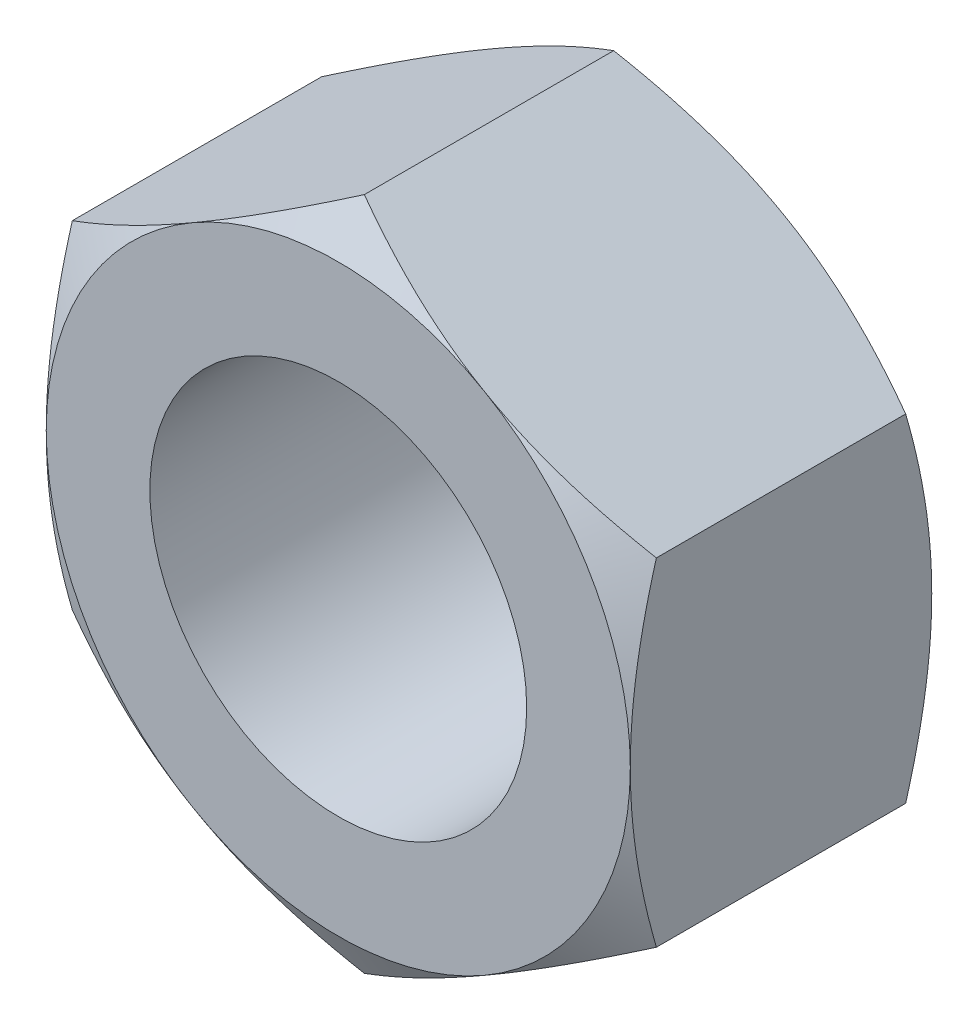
ISO-10303-21;
HEADER;
FILE_DESCRIPTION(('STEP AP214'),'2;1');
FILE_NAME('part.step','',(''),(''),'','','');
FILE_SCHEMA(('AUTOMOTIVE_DESIGN { 1 0 10303 214 1 1 1 1 }'));
ENDSEC;
DATA;
#1=APPLICATION_CONTEXT('core data for automotive mechanical design processes');
#2=APPLICATION_PROTOCOL_DEFINITION('international standard','automotive_design',2000,#1);
#3=PRODUCT_CONTEXT('',#1,'mechanical');
#4=PRODUCT('Part','Part','',(#3));
#5=PRODUCT_RELATED_PRODUCT_CATEGORY('part','',(#4));
#6=PRODUCT_DEFINITION_FORMATION('','',#4);
#7=PRODUCT_DEFINITION_CONTEXT('part definition',#1,'design');
#8=PRODUCT_DEFINITION('design','',#6,#7);
#9=PRODUCT_DEFINITION_SHAPE('','',#8);
#10=(LENGTH_UNIT() NAMED_UNIT(*) SI_UNIT(.MILLI.,.METRE.));
#11=(NAMED_UNIT(*) PLANE_ANGLE_UNIT() SI_UNIT($,.RADIAN.));
#12=(NAMED_UNIT(*) SI_UNIT($,.STERADIAN.) SOLID_ANGLE_UNIT());
#13=UNCERTAINTY_MEASURE_WITH_UNIT(LENGTH_MEASURE(1.E-05),#10,'distance_accuracy_value','');
#14=(GEOMETRIC_REPRESENTATION_CONTEXT(3) GLOBAL_UNCERTAINTY_ASSIGNED_CONTEXT((#13)) GLOBAL_UNIT_ASSIGNED_CONTEXT((#10,
#11,#12)) REPRESENTATION_CONTEXT('',''));
#15=CARTESIAN_POINT('',(0.,0.,0.));
#16=DIRECTION('',(0.,0.,1.));
#17=DIRECTION('',(1.,0.,0.));
#18=AXIS2_PLACEMENT_3D('',#15,#16,#17);
#19=CARTESIAN_POINT('',(-24.60625,14.2064250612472,12.7));
#20=DIRECTION('',(0.,0.,1.));
#21=DIRECTION('',(1.,0.,0.));
#22=AXIS2_PLACEMENT_3D('',#19,#20,#21);
#23=PLANE('',#22);
#24=CARTESIAN_POINT('',(0.,0.,12.7));
#25=DIRECTION('',(0.,0.,1.));
#26=DIRECTION('',(1.,0.,0.));
#27=AXIS2_PLACEMENT_3D('',#24,#25,#26);
#28=CIRCLE('',#27,15.875);
#29=CARTESIAN_POINT('',(15.875,0.,12.7));
#30=VERTEX_POINT('',#29);
#31=EDGE_CURVE('E272',#30,#30,#28,.T.);
#32=ORIENTED_EDGE('',*,*,#31,.F.);
#33=EDGE_LOOP('',(#32));
#34=FACE_BOUND('',#33,.T.);
#35=CARTESIAN_POINT('',(0.,0.,12.7));
#36=DIRECTION('',(0.,0.,1.));
#37=DIRECTION('',(1.,0.,0.));
#38=AXIS2_PLACEMENT_3D('',#35,#36,#37);
#39=CIRCLE('',#38,24.60625);
#40=CARTESIAN_POINT('',(12.303125,-21.3096375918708,12.7));
#41=VERTEX_POINT('',#40);
#42=CARTESIAN_POINT('',(24.60625,0.,12.7));
#43=VERTEX_POINT('',#42);
#44=EDGE_CURVE('E327',#41,#43,#39,.T.);
#45=ORIENTED_EDGE('',*,*,#44,.T.);
#46=CARTESIAN_POINT('',(12.303125,21.3096375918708,12.7));
#47=VERTEX_POINT('',#46);
#48=EDGE_CURVE('E320',#43,#47,#39,.T.);
#49=ORIENTED_EDGE('',*,*,#48,.T.);
#50=CARTESIAN_POINT('',(-12.303125,21.3096375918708,12.7));
#51=VERTEX_POINT('',#50);
#52=EDGE_CURVE('E321',#47,#51,#39,.T.);
#53=ORIENTED_EDGE('',*,*,#52,.T.);
#54=CARTESIAN_POINT('',(-24.60625,0.,12.7));
#55=VERTEX_POINT('',#54);
#56=EDGE_CURVE('E326',#51,#55,#39,.T.);
#57=ORIENTED_EDGE('',*,*,#56,.T.);
#58=CARTESIAN_POINT('',(-12.303125,-21.3096375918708,12.7));
#59=VERTEX_POINT('',#58);
#60=EDGE_CURVE('E337',#55,#59,#39,.T.);
#61=ORIENTED_EDGE('',*,*,#60,.T.);
#62=EDGE_CURVE('E334',#59,#41,#39,.T.);
#63=ORIENTED_EDGE('',*,*,#62,.T.);
#64=EDGE_LOOP('',(#45,#49,#53,#57,#61,#63));
#65=FACE_BOUND('',#64,.T.);
#66=ADVANCED_FACE('F47',(#34,#65),#23,.T.);
#67=CARTESIAN_POINT('',(0.,28.4128501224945,12.7));
#68=DIRECTION('',(0.5,-0.866025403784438,0.));
#69=DIRECTION('',(0.866025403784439,0.5,0.));
#70=AXIS2_PLACEMENT_3D('',#67,#68,#69);
#71=PLANE('',#70);
#72=DIRECTION('',(0.,0.,-1.));
#73=VECTOR('',#72,1.);
#74=CARTESIAN_POINT('',(0.,28.4128501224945,12.7));
#75=LINE('',#74,#73);
#76=CARTESIAN_POINT('',(0.,28.4128501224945,10.5022583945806));
#77=VERTEX_POINT('',#76);
#78=CARTESIAN_POINT('',(0.,28.4128501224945,-10.5022583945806));
#79=VERTEX_POINT('',#78);
#80=EDGE_CURVE('E280',#77,#79,#75,.T.);
#81=ORIENTED_EDGE('',*,*,#80,.T.);
#82=CARTESIAN_POINT('',(0.000199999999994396,28.4129655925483,-10.5021917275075));
#83=CARTESIAN_POINT('',(-0.540634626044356,28.1007145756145,-10.6824567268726));
#84=CARTESIAN_POINT('',(-1.08357879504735,27.7872456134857,-10.85454151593));
#85=CARTESIAN_POINT('',(-2.17382089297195,27.1577940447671,-11.1800768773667));
#86=CARTESIAN_POINT('',(-2.72112019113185,26.8418106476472,-11.3335213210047));
#87=CARTESIAN_POINT('',(-3.82114195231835,26.2067127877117,-11.6197164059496));
#88=CARTESIAN_POINT('',(-4.37387412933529,25.8875927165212,-11.7524176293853));
#89=CARTESIAN_POINT('',(-5.48315569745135,25.2471487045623,-11.9942675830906));
#90=CARTESIAN_POINT('',(-6.03970470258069,24.9258249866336,-12.1034186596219));
#91=CARTESIAN_POINT('',(-7.1423940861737,24.2891869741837,-12.2935350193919));
#92=CARTESIAN_POINT('',(-7.68845267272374,23.9739199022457,-12.3751290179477));
#93=CARTESIAN_POINT('',(-8.78307192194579,23.3419411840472,-12.5119434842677));
#94=CARTESIAN_POINT('',(-9.33163263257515,23.0252295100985,-12.567163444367));
#95=CARTESIAN_POINT('',(-10.4296755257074,22.3912741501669,-12.6498355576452));
#96=CARTESIAN_POINT('',(-10.9791558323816,22.0740315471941,-12.6773207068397));
#97=CARTESIAN_POINT('',(-12.0786235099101,21.4392535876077,-12.7039321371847));
#98=CARTESIAN_POINT('',(-12.6286108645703,21.1217182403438,-12.7030592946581));
#99=CARTESIAN_POINT('',(-13.6568203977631,20.5280811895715,-12.6749354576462));
#100=CARTESIAN_POINT('',(-14.1351158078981,20.251937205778,-12.6511139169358));
#101=CARTESIAN_POINT('',(-15.0905647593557,19.700308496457,-12.582476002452));
#102=CARTESIAN_POINT('',(-15.5677183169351,19.4248237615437,-12.5376599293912));
#103=CARTESIAN_POINT('',(-16.5207072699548,18.874615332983,-12.4278096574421));
#104=CARTESIAN_POINT('',(-16.9965410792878,18.5998925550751,-12.3627571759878));
#105=CARTESIAN_POINT('',(-17.9459303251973,18.0517624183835,-12.2135854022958));
#106=CARTESIAN_POINT('',(-18.4194857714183,17.7783550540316,-12.1294661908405));
#107=CARTESIAN_POINT('',(-19.8570992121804,16.948348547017,-11.8463496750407));
#108=CARTESIAN_POINT('',(-20.817072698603,16.394107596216,-11.619107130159));
#109=CARTESIAN_POINT('',(-22.2464314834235,15.5688669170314,-11.2322374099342));
#110=CARTESIAN_POINT('',(-22.7207079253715,15.2950432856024,-11.0957523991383));
#111=CARTESIAN_POINT('',(-23.6659803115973,14.7492900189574,-10.8089649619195));
#112=CARTESIAN_POINT('',(-24.1369771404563,14.4773598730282,-10.6586664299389));
#113=CARTESIAN_POINT('',(-24.60645,14.2063095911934,-10.5021917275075));
#114=B_SPLINE_CURVE_WITH_KNOTS('',3,(#82,#83,#84,#85,#86,#87,#88,#89,#90,#91,#92,#93,#94,#95,
#96,#97,#98,#99,#100,#101,#102,#103,#104,#105,#106,#107,#108,#109,#110,#111,#112,#113),
.UNSPECIFIED.,.F.,.F.,(4,2,2,2,2,2,2,2,2,2,2,2,2,2,2,4),(0.,1.95004700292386,3.9007334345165,
5.85599851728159,7.81106871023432,9.71792428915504,11.6248165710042,13.5294375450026,
15.4339996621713,17.0920036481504,18.7499838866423,20.4094663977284,22.068941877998,
25.4609898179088,27.1540591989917,28.8466527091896),.UNSPECIFIED.);
#115=CARTESIAN_POINT('',(-12.303125,21.3096375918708,-12.7));
#116=VERTEX_POINT('',#115);
#117=EDGE_CURVE('E71',#79,#116,#114,.T.);
#118=ORIENTED_EDGE('',*,*,#117,.T.);
#119=CARTESIAN_POINT('',(-24.60625,14.2064250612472,-10.5022583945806));
#120=VERTEX_POINT('',#119);
#121=EDGE_CURVE('E200',#116,#120,#114,.T.);
#122=ORIENTED_EDGE('',*,*,#121,.T.);
#123=DIRECTION('',(0.,0.,-1.));
#124=VECTOR('',#123,1.);
#125=CARTESIAN_POINT('',(-24.60625,14.2064250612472,12.7));
#126=LINE('',#125,#124);
#127=CARTESIAN_POINT('',(-24.60625,14.2064250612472,10.5022583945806));
#128=VERTEX_POINT('',#127);
#129=EDGE_CURVE('E300',#128,#120,#126,.T.);
#130=ORIENTED_EDGE('',*,*,#129,.F.);
#131=CARTESIAN_POINT('',(0.000199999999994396,28.4129655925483,10.5021917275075));
#132=CARTESIAN_POINT('',(-0.540634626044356,28.1007145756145,10.6824567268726));
#133=CARTESIAN_POINT('',(-1.08357879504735,27.7872456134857,10.85454151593));
#134=CARTESIAN_POINT('',(-2.17382089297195,27.1577940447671,11.1800768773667));
#135=CARTESIAN_POINT('',(-2.72112019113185,26.8418106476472,11.3335213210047));
#136=CARTESIAN_POINT('',(-3.82114195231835,26.2067127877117,11.6197164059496));
#137=CARTESIAN_POINT('',(-4.37387412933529,25.8875927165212,11.7524176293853));
#138=CARTESIAN_POINT('',(-5.48315569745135,25.2471487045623,11.9942675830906));
#139=CARTESIAN_POINT('',(-6.03970470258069,24.9258249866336,12.1034186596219));
#140=CARTESIAN_POINT('',(-7.1423940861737,24.2891869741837,12.2935350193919));
#141=CARTESIAN_POINT('',(-7.68845267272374,23.9739199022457,12.3751290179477));
#142=CARTESIAN_POINT('',(-8.78307192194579,23.3419411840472,12.5119434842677));
#143=CARTESIAN_POINT('',(-9.33163263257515,23.0252295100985,12.567163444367));
#144=CARTESIAN_POINT('',(-10.4296755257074,22.3912741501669,12.6498355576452));
#145=CARTESIAN_POINT('',(-10.9791558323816,22.0740315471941,12.6773207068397));
#146=CARTESIAN_POINT('',(-12.0786235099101,21.4392535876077,12.7039321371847));
#147=CARTESIAN_POINT('',(-12.6286108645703,21.1217182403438,12.7030592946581));
#148=CARTESIAN_POINT('',(-13.6568203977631,20.5280811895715,12.6749354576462));
#149=CARTESIAN_POINT('',(-14.1351158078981,20.251937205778,12.6511139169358));
#150=CARTESIAN_POINT('',(-15.0905647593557,19.700308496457,12.582476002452));
#151=CARTESIAN_POINT('',(-15.5677183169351,19.4248237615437,12.5376599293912));
#152=CARTESIAN_POINT('',(-16.5207072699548,18.874615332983,12.4278096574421));
#153=CARTESIAN_POINT('',(-16.9965410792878,18.5998925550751,12.3627571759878));
#154=CARTESIAN_POINT('',(-17.9459303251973,18.0517624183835,12.2135854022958));
#155=CARTESIAN_POINT('',(-18.4194857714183,17.7783550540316,12.1294661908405));
#156=CARTESIAN_POINT('',(-19.8570992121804,16.948348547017,11.8463496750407));
#157=CARTESIAN_POINT('',(-20.817072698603,16.394107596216,11.619107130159));
#158=CARTESIAN_POINT('',(-22.2464314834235,15.5688669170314,11.2322374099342));
#159=CARTESIAN_POINT('',(-22.7207079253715,15.2950432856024,11.0957523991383));
#160=CARTESIAN_POINT('',(-23.6659803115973,14.7492900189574,10.8089649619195));
#161=CARTESIAN_POINT('',(-24.1369771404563,14.4773598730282,10.6586664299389));
#162=CARTESIAN_POINT('',(-24.60645,14.2063095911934,10.5021917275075));
#163=B_SPLINE_CURVE_WITH_KNOTS('',3,(#131,#132,#133,#134,#135,#136,#137,#138,#139,#140,#141,
#142,#143,#144,#145,#146,#147,#148,#149,#150,#151,#152,#153,#154,#155,#156,#157,#158,#159,#160,
#161,#162),.UNSPECIFIED.,.F.,.F.,(4,2,2,2,2,2,2,2,2,2,2,2,2,2,2,4),(0.,1.95004700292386,
3.9007334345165,5.85599851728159,7.81106871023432,9.71792428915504,11.6248165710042,
13.5294375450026,15.4339996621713,17.0920036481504,18.7499838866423,20.4094663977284,
22.068941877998,25.4609898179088,27.1540591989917,28.8466527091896),.UNSPECIFIED.);
#164=EDGE_CURVE('E264',#51,#128,#163,.T.);
#165=ORIENTED_EDGE('',*,*,#164,.F.);
#166=EDGE_CURVE('E275',#77,#51,#163,.T.);
#167=ORIENTED_EDGE('',*,*,#166,.F.);
#168=EDGE_LOOP('',(#81,#118,#122,#130,#165,#167));
#169=FACE_BOUND('',#168,.T.);
#170=ADVANCED_FACE('F51',(#169),#71,.F.);
#171=CARTESIAN_POINT('',(-24.60625,14.2064250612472,12.7));
#172=DIRECTION('',(1.,0.,0.));
#173=DIRECTION('',(0.,0.,-1.));
#174=AXIS2_PLACEMENT_3D('',#171,#172,#173);
#175=PLANE('',#174);
#176=ORIENTED_EDGE('',*,*,#129,.T.);
#177=CARTESIAN_POINT('',(-24.60625,-38.1826894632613,-0.680577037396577));
#178=CARTESIAN_POINT('',(-24.60625,-37.6450994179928,-0.941465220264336));
#179=CARTESIAN_POINT('',(-24.60625,-37.1068785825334,-1.20105747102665));
#180=CARTESIAN_POINT('',(-24.60625,-36.0290444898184,-1.71734829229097));
#181=CARTESIAN_POINT('',(-24.60625,-35.4894312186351,-1.97404683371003));
#182=CARTESIAN_POINT('',(-24.60625,-34.4086087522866,-2.48428256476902));
#183=CARTESIAN_POINT('',(-24.60625,-33.8673993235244,-2.73781926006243));
#184=CARTESIAN_POINT('',(-24.60625,-32.7833269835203,-3.24132770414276));
#185=CARTESIAN_POINT('',(-24.60625,-32.2404640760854,-3.49129946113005));
#186=CARTESIAN_POINT('',(-24.60625,-30.6032561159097,-4.23797142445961));
#187=CARTESIAN_POINT('',(-24.60625,-29.5061537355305,-4.72865082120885));
#188=CARTESIAN_POINT('',(-24.60625,-27.30322390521,-5.68997716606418));
#189=CARTESIAN_POINT('',(-24.60625,-26.1973968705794,-6.16062506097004));
#190=CARTESIAN_POINT('',(-24.60625,-24.513238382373,-6.85477559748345));
#191=CARTESIAN_POINT('',(-24.60625,-23.9387476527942,-7.08760530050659));
#192=CARTESIAN_POINT('',(-24.60625,-22.7867140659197,-7.5455777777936));
#193=CARTESIAN_POINT('',(-24.60625,-22.2091712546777,-7.77072066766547));
#194=CARTESIAN_POINT('',(-24.60625,-21.0506710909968,-8.21231706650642));
#195=CARTESIAN_POINT('',(-24.60625,-20.4697132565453,-8.42876931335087));
#196=CARTESIAN_POINT('',(-24.60625,-19.3042037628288,-8.85174521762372));
#197=CARTESIAN_POINT('',(-24.60625,-18.7196521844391,-9.05826909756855));
#198=CARTESIAN_POINT('',(-24.60625,-17.5478548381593,-9.45962283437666));
#199=CARTESIAN_POINT('',(-24.60625,-16.9606169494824,-9.65447558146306));
#200=CARTESIAN_POINT('',(-24.60625,-15.7820620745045,-10.031390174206));
#201=CARTESIAN_POINT('',(-24.60625,-15.1907450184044,-10.2134518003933));
#202=CARTESIAN_POINT('',(-24.60625,-13.4106457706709,-10.7378258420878));
#203=CARTESIAN_POINT('',(-24.60625,-12.2152681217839,-11.0584833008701));
#204=CARTESIAN_POINT('',(-24.60625,-10.4124329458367,-11.4836291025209));
#205=CARTESIAN_POINT('',(-24.60625,-9.81142756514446,-11.6157672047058));
#206=CARTESIAN_POINT('',(-24.60625,-8.60530083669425,-11.8598338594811));
#207=CARTESIAN_POINT('',(-24.60625,-8.00017957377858,-11.9717628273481));
#208=CARTESIAN_POINT('',(-24.60625,-6.78625829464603,-12.1734343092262));
#209=CARTESIAN_POINT('',(-24.60625,-6.17745842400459,-12.2631776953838));
#210=CARTESIAN_POINT('',(-24.60625,-4.95678327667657,-12.4186952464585));
#211=CARTESIAN_POINT('',(-24.60625,-4.34490800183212,-12.4844694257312));
#212=CARTESIAN_POINT('',(-24.60625,-3.12697499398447,-12.58990980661));
#213=CARTESIAN_POINT('',(-24.60625,-2.52094607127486,-12.6299067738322));
#214=CARTESIAN_POINT('',(-24.60625,-1.30774104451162,-12.6842357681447));
#215=CARTESIAN_POINT('',(-24.60625,-0.700564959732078,-12.6985682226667));
#216=CARTESIAN_POINT('',(-24.60625,0.513860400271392,-12.701227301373));
#217=CARTESIAN_POINT('',(-24.60625,1.12110967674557,-12.6895533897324));
#218=CARTESIAN_POINT('',(-24.60625,2.33457470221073,-12.6404837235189));
#219=CARTESIAN_POINT('',(-24.60625,2.94079040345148,-12.6030868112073));
#220=CARTESIAN_POINT('',(-24.60625,4.39649290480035,-12.4831939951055));
#221=CARTESIAN_POINT('',(-24.60625,5.24499778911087,-12.3885627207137));
#222=CARTESIAN_POINT('',(-24.60625,6.93573472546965,-12.1540499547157));
#223=CARTESIAN_POINT('',(-24.60625,7.7779659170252,-12.0141623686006));
#224=CARTESIAN_POINT('',(-24.60625,9.45532035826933,-11.6941127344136));
#225=CARTESIAN_POINT('',(-24.60625,10.2904378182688,-11.5139206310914));
#226=CARTESIAN_POINT('',(-24.60625,11.9523118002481,-11.1187538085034));
#227=CARTESIAN_POINT('',(-24.60625,12.7790684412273,-10.9037795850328));
#228=CARTESIAN_POINT('',(-24.60625,14.4434916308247,-10.4388911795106));
#229=CARTESIAN_POINT('',(-24.60625,15.2809615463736,-10.1882778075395));
#230=CARTESIAN_POINT('',(-24.60625,16.9476446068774,-9.66109580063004));
#231=CARTESIAN_POINT('',(-24.60625,17.7768576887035,-9.38452696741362));
#232=CARTESIAN_POINT('',(-24.60625,19.4274591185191,-8.80982915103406));
#233=CARTESIAN_POINT('',(-24.60625,20.2488498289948,-8.51170692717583));
#234=CARTESIAN_POINT('',(-24.60625,21.4758112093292,-8.05099528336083));
#235=CARTESIAN_POINT('',(-24.60625,21.8839419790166,-7.89517091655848));
#236=CARTESIAN_POINT('',(-24.60625,22.6986029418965,-7.57938908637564));
#237=CARTESIAN_POINT('',(-24.60625,23.1051331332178,-7.41943161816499));
#238=CARTESIAN_POINT('',(-24.60625,24.217432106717,-6.97579170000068));
#239=CARTESIAN_POINT('',(-24.60625,24.9216730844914,-6.68827568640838));
#240=CARTESIAN_POINT('',(-24.60625,26.3260776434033,-6.10343309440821));
#241=CARTESIAN_POINT('',(-24.60625,27.0262411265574,-5.80610628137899));
#242=CARTESIAN_POINT('',(-24.60625,28.4229757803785,-5.20298305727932));
#243=CARTESIAN_POINT('',(-24.60625,29.119546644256,-4.89718593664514));
#244=CARTESIAN_POINT('',(-24.60625,30.5094402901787,-4.27828732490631));
#245=CARTESIAN_POINT('',(-24.60625,31.2027630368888,-3.96518575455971));
#246=CARTESIAN_POINT('',(-24.60625,32.5867622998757,-3.33252812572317));
#247=CARTESIAN_POINT('',(-24.60625,33.2774377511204,-3.01296973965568));
#248=CARTESIAN_POINT('',(-24.60625,34.6562013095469,-2.36831535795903));
#249=CARTESIAN_POINT('',(-24.60625,35.3442894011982,-2.04321932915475));
#250=CARTESIAN_POINT('',(-24.60625,37.405027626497,-1.06071732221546));
#251=CARTESIAN_POINT('',(-24.60625,38.7742243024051,-0.396064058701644));
#252=CARTESIAN_POINT('',(-24.60625,41.5073830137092,0.949277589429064));
#253=CARTESIAN_POINT('',(-24.60625,42.8713333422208,1.62998967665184));
#254=CARTESIAN_POINT('',(-24.60625,45.593246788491,3.00329521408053));
#255=CARTESIAN_POINT('',(-24.60625,46.9512098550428,3.69588876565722));
#256=CARTESIAN_POINT('',(-24.60625,49.661941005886,5.09043862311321));
#257=CARTESIAN_POINT('',(-24.60625,51.0147101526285,5.79239286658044));
#258=CARTESIAN_POINT('',(-24.60625,53.7162039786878,7.2040241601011));
#259=CARTESIAN_POINT('',(-24.60625,55.0649286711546,7.91370118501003));
#260=CARTESIAN_POINT('',(-24.60625,57.6140179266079,9.26267730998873));
#261=CARTESIAN_POINT('',(-24.60625,58.8147252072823,9.90132934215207));
#262=CARTESIAN_POINT('',(-24.60625,61.2138484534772,11.1829247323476));
#263=CARTESIAN_POINT('',(-24.60625,62.4122644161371,11.8258680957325));
#264=CARTESIAN_POINT('',(-24.60625,64.8071944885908,13.1154581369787));
#265=CARTESIAN_POINT('',(-24.60625,66.0037084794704,13.7621050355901));
#266=CARTESIAN_POINT('',(-24.60625,68.3950264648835,15.0585532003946));
#267=CARTESIAN_POINT('',(-24.60625,69.589830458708,15.7083544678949));
#268=CARTESIAN_POINT('',(-24.60625,71.974061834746,17.0085701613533));
#269=CARTESIAN_POINT('',(-24.60625,73.1634940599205,17.6589757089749));
#270=CARTESIAN_POINT('',(-24.60625,75.5410605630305,18.9621551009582));
#271=CARTESIAN_POINT('',(-24.60625,76.7291948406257,19.6149289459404));
#272=CARTESIAN_POINT('',(-24.60625,79.1042288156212,20.9225010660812));
#273=CARTESIAN_POINT('',(-24.60625,80.2911286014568,21.5772991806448));
#274=CARTESIAN_POINT('',(-24.60625,82.6639116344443,22.8887315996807));
#275=CARTESIAN_POINT('',(-24.60625,83.8497948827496,23.5453659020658));
#276=CARTESIAN_POINT('',(-24.60625,85.0352341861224,24.2027997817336));
#277=B_SPLINE_CURVE_WITH_KNOTS('',3,(#177,#178,#179,#180,#181,#182,#183,#184,#185,#186,#187,
#188,#189,#190,#191,#192,#193,#194,#195,#196,#197,#198,#199,#200,#201,#202,#203,#204,#205,#206,
#207,#208,#209,#210,#211,#212,#213,#214,#215,#216,#217,#218,#219,#220,#221,#222,#223,#224,#225,
#226,#227,#228,#229,#230,#231,#232,#233,#234,#235,#236,#237,#238,#239,#240,#241,#242,#243,#244,
#245,#246,#247,#248,#249,#250,#251,#252,#253,#254,#255,#256,#257,#258,#259,#260,#261,#262,#263,
#264,#265,#266,#267,#268,#269,#270,#271,#272,#273,#274,#275,#276),.UNSPECIFIED.,.F.,.F.,(4,2,2,
2,2,2,2,2,2,2,2,2,2,2,2,2,2,2,2,2,2,2,2,2,2,2,2,2,2,2,2,2,2,2,2,2,2,2,2,2,2,2,2,2,2,2,2,2,2,4),
(0.,1.79264991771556,3.58531783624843,5.37826260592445,7.17120325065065,10.7765427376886,
14.3817116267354,16.24130196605,18.1008643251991,19.9606957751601,21.8204855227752,
23.676499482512,25.5325452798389,29.2432167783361,31.0890237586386,32.9347928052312,
34.7804892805,36.6261846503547,38.4476984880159,40.2691819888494,42.0907030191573,
43.9123060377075,46.4721885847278,49.0324160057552,51.5945590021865,54.156665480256,
56.7786538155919,59.4006621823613,62.0218518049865,63.3324321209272,64.6430139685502,
66.9249339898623,69.2069086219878,71.4890749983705,73.7712661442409,76.0542952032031,
78.3373379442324,82.903183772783,87.4762522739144,92.0493598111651,96.6214758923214,
101.193577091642,105.273539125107,109.353506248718,113.433719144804,117.513933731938,
121.580869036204,125.647805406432,129.714427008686,133.781043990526),.UNSPECIFIED.);
#278=CARTESIAN_POINT('',(-24.60625,0.,-12.7));
#279=VERTEX_POINT('',#278);
#280=EDGE_CURVE('E338',#120,#279,#277,.F.);
#281=ORIENTED_EDGE('',*,*,#280,.T.);
#282=CARTESIAN_POINT('',(-24.60625,-14.2064250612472,-10.5022583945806));
#283=VERTEX_POINT('',#282);
#284=EDGE_CURVE('E227',#279,#283,#277,.F.);
#285=ORIENTED_EDGE('',*,*,#284,.T.);
#286=DIRECTION('',(0.,0.,-1.));
#287=VECTOR('',#286,1.);
#288=CARTESIAN_POINT('',(-24.60625,-14.2064250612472,12.7));
#289=LINE('',#288,#287);
#290=CARTESIAN_POINT('',(-24.60625,-14.2064250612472,10.5022583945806));
#291=VERTEX_POINT('',#290);
#292=EDGE_CURVE('E294',#291,#283,#289,.T.);
#293=ORIENTED_EDGE('',*,*,#292,.F.);
#294=CARTESIAN_POINT('',(-24.60625,-38.1826894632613,0.680577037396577));
#295=CARTESIAN_POINT('',(-24.60625,-37.6450994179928,0.941465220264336));
#296=CARTESIAN_POINT('',(-24.60625,-37.1068785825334,1.20105747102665));
#297=CARTESIAN_POINT('',(-24.60625,-36.0290444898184,1.71734829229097));
#298=CARTESIAN_POINT('',(-24.60625,-35.4894312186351,1.97404683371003));
#299=CARTESIAN_POINT('',(-24.60625,-34.4086087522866,2.48428256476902));
#300=CARTESIAN_POINT('',(-24.60625,-33.8673993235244,2.73781926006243));
#301=CARTESIAN_POINT('',(-24.60625,-32.7833269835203,3.24132770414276));
#302=CARTESIAN_POINT('',(-24.60625,-32.2404640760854,3.49129946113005));
#303=CARTESIAN_POINT('',(-24.60625,-30.6032561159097,4.23797142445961));
#304=CARTESIAN_POINT('',(-24.60625,-29.5061537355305,4.72865082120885));
#305=CARTESIAN_POINT('',(-24.60625,-27.30322390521,5.68997716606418));
#306=CARTESIAN_POINT('',(-24.60625,-26.1973968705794,6.16062506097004));
#307=CARTESIAN_POINT('',(-24.60625,-24.513238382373,6.85477559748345));
#308=CARTESIAN_POINT('',(-24.60625,-23.9387476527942,7.08760530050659));
#309=CARTESIAN_POINT('',(-24.60625,-22.7867140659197,7.5455777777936));
#310=CARTESIAN_POINT('',(-24.60625,-22.2091712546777,7.77072066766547));
#311=CARTESIAN_POINT('',(-24.60625,-21.0506710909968,8.21231706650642));
#312=CARTESIAN_POINT('',(-24.60625,-20.4697132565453,8.42876931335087));
#313=CARTESIAN_POINT('',(-24.60625,-19.3042037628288,8.85174521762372));
#314=CARTESIAN_POINT('',(-24.60625,-18.7196521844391,9.05826909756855));
#315=CARTESIAN_POINT('',(-24.60625,-17.5478548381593,9.45962283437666));
#316=CARTESIAN_POINT('',(-24.60625,-16.9606169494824,9.65447558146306));
#317=CARTESIAN_POINT('',(-24.60625,-15.7820620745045,10.031390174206));
#318=CARTESIAN_POINT('',(-24.60625,-15.1907450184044,10.2134518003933));
#319=CARTESIAN_POINT('',(-24.60625,-13.4106457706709,10.7378258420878));
#320=CARTESIAN_POINT('',(-24.60625,-12.2152681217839,11.0584833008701));
#321=CARTESIAN_POINT('',(-24.60625,-10.4124329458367,11.4836291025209));
#322=CARTESIAN_POINT('',(-24.60625,-9.81142756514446,11.6157672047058));
#323=CARTESIAN_POINT('',(-24.60625,-8.60530083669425,11.8598338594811));
#324=CARTESIAN_POINT('',(-24.60625,-8.00017957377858,11.9717628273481));
#325=CARTESIAN_POINT('',(-24.60625,-6.78625829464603,12.1734343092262));
#326=CARTESIAN_POINT('',(-24.60625,-6.17745842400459,12.2631776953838));
#327=CARTESIAN_POINT('',(-24.60625,-4.95678327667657,12.4186952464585));
#328=CARTESIAN_POINT('',(-24.60625,-4.34490800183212,12.4844694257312));
#329=CARTESIAN_POINT('',(-24.60625,-3.12697499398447,12.58990980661));
#330=CARTESIAN_POINT('',(-24.60625,-2.52094607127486,12.6299067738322));
#331=CARTESIAN_POINT('',(-24.60625,-1.30774104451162,12.6842357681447));
#332=CARTESIAN_POINT('',(-24.60625,-0.700564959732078,12.6985682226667));
#333=CARTESIAN_POINT('',(-24.60625,0.513860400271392,12.701227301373));
#334=CARTESIAN_POINT('',(-24.60625,1.12110967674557,12.6895533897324));
#335=CARTESIAN_POINT('',(-24.60625,2.33457470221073,12.6404837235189));
#336=CARTESIAN_POINT('',(-24.60625,2.94079040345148,12.6030868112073));
#337=CARTESIAN_POINT('',(-24.60625,4.39649290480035,12.4831939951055));
#338=CARTESIAN_POINT('',(-24.60625,5.24499778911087,12.3885627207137));
#339=CARTESIAN_POINT('',(-24.60625,6.93573472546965,12.1540499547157));
#340=CARTESIAN_POINT('',(-24.60625,7.7779659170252,12.0141623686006));
#341=CARTESIAN_POINT('',(-24.60625,9.45532035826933,11.6941127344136));
#342=CARTESIAN_POINT('',(-24.60625,10.2904378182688,11.5139206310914));
#343=CARTESIAN_POINT('',(-24.60625,11.9523118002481,11.1187538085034));
#344=CARTESIAN_POINT('',(-24.60625,12.7790684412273,10.9037795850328));
#345=CARTESIAN_POINT('',(-24.60625,14.4434916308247,10.4388911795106));
#346=CARTESIAN_POINT('',(-24.60625,15.2809615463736,10.1882778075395));
#347=CARTESIAN_POINT('',(-24.60625,16.9476446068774,9.66109580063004));
#348=CARTESIAN_POINT('',(-24.60625,17.7768576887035,9.38452696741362));
#349=CARTESIAN_POINT('',(-24.60625,19.4274591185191,8.80982915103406));
#350=CARTESIAN_POINT('',(-24.60625,20.2488498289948,8.51170692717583));
#351=CARTESIAN_POINT('',(-24.60625,21.4758112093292,8.05099528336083));
#352=CARTESIAN_POINT('',(-24.60625,21.8839419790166,7.89517091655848));
#353=CARTESIAN_POINT('',(-24.60625,22.6986029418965,7.57938908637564));
#354=CARTESIAN_POINT('',(-24.60625,23.1051331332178,7.41943161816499));
#355=CARTESIAN_POINT('',(-24.60625,24.217432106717,6.97579170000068));
#356=CARTESIAN_POINT('',(-24.60625,24.9216730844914,6.68827568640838));
#357=CARTESIAN_POINT('',(-24.60625,26.3260776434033,6.10343309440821));
#358=CARTESIAN_POINT('',(-24.60625,27.0262411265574,5.80610628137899));
#359=CARTESIAN_POINT('',(-24.60625,28.4229757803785,5.20298305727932));
#360=CARTESIAN_POINT('',(-24.60625,29.119546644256,4.89718593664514));
#361=CARTESIAN_POINT('',(-24.60625,30.5094402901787,4.27828732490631));
#362=CARTESIAN_POINT('',(-24.60625,31.2027630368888,3.96518575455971));
#363=CARTESIAN_POINT('',(-24.60625,32.5867622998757,3.33252812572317));
#364=CARTESIAN_POINT('',(-24.60625,33.2774377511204,3.01296973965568));
#365=CARTESIAN_POINT('',(-24.60625,34.6562013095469,2.36831535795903));
#366=CARTESIAN_POINT('',(-24.60625,35.3442894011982,2.04321932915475));
#367=CARTESIAN_POINT('',(-24.60625,37.405027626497,1.06071732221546));
#368=CARTESIAN_POINT('',(-24.60625,38.7742243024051,0.396064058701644));
#369=CARTESIAN_POINT('',(-24.60625,41.5073830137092,-0.949277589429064));
#370=CARTESIAN_POINT('',(-24.60625,42.8713333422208,-1.62998967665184));
#371=CARTESIAN_POINT('',(-24.60625,45.593246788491,-3.00329521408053));
#372=CARTESIAN_POINT('',(-24.60625,46.9512098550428,-3.69588876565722));
#373=CARTESIAN_POINT('',(-24.60625,49.661941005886,-5.09043862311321));
#374=CARTESIAN_POINT('',(-24.60625,51.0147101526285,-5.79239286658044));
#375=CARTESIAN_POINT('',(-24.60625,53.7162039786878,-7.2040241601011));
#376=CARTESIAN_POINT('',(-24.60625,55.0649286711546,-7.91370118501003));
#377=CARTESIAN_POINT('',(-24.60625,57.6140179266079,-9.26267730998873));
#378=CARTESIAN_POINT('',(-24.60625,58.8147252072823,-9.90132934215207));
#379=CARTESIAN_POINT('',(-24.60625,61.2138484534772,-11.1829247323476));
#380=CARTESIAN_POINT('',(-24.60625,62.4122644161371,-11.8258680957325));
#381=CARTESIAN_POINT('',(-24.60625,64.8071944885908,-13.1154581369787));
#382=CARTESIAN_POINT('',(-24.60625,66.0037084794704,-13.7621050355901));
#383=CARTESIAN_POINT('',(-24.60625,68.3950264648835,-15.0585532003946));
#384=CARTESIAN_POINT('',(-24.60625,69.589830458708,-15.7083544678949));
#385=CARTESIAN_POINT('',(-24.60625,71.974061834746,-17.0085701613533));
#386=CARTESIAN_POINT('',(-24.60625,73.1634940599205,-17.6589757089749));
#387=CARTESIAN_POINT('',(-24.60625,75.5410605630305,-18.9621551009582));
#388=CARTESIAN_POINT('',(-24.60625,76.7291948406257,-19.6149289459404));
#389=CARTESIAN_POINT('',(-24.60625,79.1042288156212,-20.9225010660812));
#390=CARTESIAN_POINT('',(-24.60625,80.2911286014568,-21.5772991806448));
#391=CARTESIAN_POINT('',(-24.60625,82.6639116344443,-22.8887315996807));
#392=CARTESIAN_POINT('',(-24.60625,83.8497948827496,-23.5453659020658));
#393=CARTESIAN_POINT('',(-24.60625,85.0352341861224,-24.2027997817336));
#394=B_SPLINE_CURVE_WITH_KNOTS('',3,(#294,#295,#296,#297,#298,#299,#300,#301,#302,#303,#304,
#305,#306,#307,#308,#309,#310,#311,#312,#313,#314,#315,#316,#317,#318,#319,#320,#321,#322,#323,
#324,#325,#326,#327,#328,#329,#330,#331,#332,#333,#334,#335,#336,#337,#338,#339,#340,#341,#342,
#343,#344,#345,#346,#347,#348,#349,#350,#351,#352,#353,#354,#355,#356,#357,#358,#359,#360,#361,
#362,#363,#364,#365,#366,#367,#368,#369,#370,#371,#372,#373,#374,#375,#376,#377,#378,#379,#380,
#381,#382,#383,#384,#385,#386,#387,#388,#389,#390,#391,#392,#393),.UNSPECIFIED.,.F.,.F.,(4,2,2,
2,2,2,2,2,2,2,2,2,2,2,2,2,2,2,2,2,2,2,2,2,2,2,2,2,2,2,2,2,2,2,2,2,2,2,2,2,2,2,2,2,2,2,2,2,2,4),
(0.,1.79264991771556,3.58531783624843,5.37826260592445,7.17120325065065,10.7765427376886,
14.3817116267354,16.24130196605,18.1008643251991,19.9606957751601,21.8204855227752,
23.676499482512,25.5325452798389,29.2432167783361,31.0890237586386,32.9347928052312,
34.7804892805,36.6261846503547,38.4476984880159,40.2691819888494,42.0907030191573,
43.9123060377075,46.4721885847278,49.0324160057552,51.5945590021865,54.156665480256,
56.7786538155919,59.4006621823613,62.0218518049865,63.3324321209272,64.6430139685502,
66.9249339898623,69.2069086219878,71.4890749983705,73.7712661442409,76.0542952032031,
78.3373379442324,82.903183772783,87.4762522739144,92.0493598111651,96.6214758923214,
101.193577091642,105.273539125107,109.353506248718,113.433719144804,117.513933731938,
121.580869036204,125.647805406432,129.714427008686,133.781043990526),.UNSPECIFIED.);
#395=EDGE_CURVE('E260',#55,#291,#394,.F.);
#396=ORIENTED_EDGE('',*,*,#395,.F.);
#397=EDGE_CURVE('E262',#128,#55,#394,.F.);
#398=ORIENTED_EDGE('',*,*,#397,.F.);
#399=EDGE_LOOP('',(#176,#281,#285,#293,#396,#398));
#400=FACE_BOUND('',#399,.T.);
#401=ADVANCED_FACE('F234',(#400),#175,.F.);
#402=CARTESIAN_POINT('',(-24.60625,-14.2064250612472,12.7));
#403=DIRECTION('',(0.5,0.866025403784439,0.));
#404=DIRECTION('',(-0.866025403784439,0.5,0.));
#405=AXIS2_PLACEMENT_3D('',#402,#403,#404);
#406=PLANE('',#405);
#407=ORIENTED_EDGE('',*,*,#292,.T.);
#408=CARTESIAN_POINT('',(-24.60645,-14.2063095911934,-10.5021917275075));
#409=CARTESIAN_POINT('',(-24.0656153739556,-14.5185606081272,-10.6824567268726));
#410=CARTESIAN_POINT('',(-23.5226712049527,-14.832029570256,-10.85454151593));
#411=CARTESIAN_POINT('',(-22.4324291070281,-15.4614811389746,-11.1800768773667));
#412=CARTESIAN_POINT('',(-21.8851298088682,-15.7774645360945,-11.3335213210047));
#413=CARTESIAN_POINT('',(-20.7851080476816,-16.41256239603,-11.6197164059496));
#414=CARTESIAN_POINT('',(-20.2323758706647,-16.7316824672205,-11.7524176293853));
#415=CARTESIAN_POINT('',(-19.1230943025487,-17.3721264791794,-11.9942675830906));
#416=CARTESIAN_POINT('',(-18.5665452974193,-17.693450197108,-12.1034186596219));
#417=CARTESIAN_POINT('',(-17.4638559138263,-18.330088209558,-12.2935350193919));
#418=CARTESIAN_POINT('',(-16.9177973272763,-18.645355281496,-12.3751290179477));
#419=CARTESIAN_POINT('',(-15.8231780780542,-19.2773339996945,-12.5119434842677));
#420=CARTESIAN_POINT('',(-15.2746173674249,-19.5940456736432,-12.567163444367));
#421=CARTESIAN_POINT('',(-14.1765744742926,-20.2280010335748,-12.6498355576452));
#422=CARTESIAN_POINT('',(-13.6270941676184,-20.5452436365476,-12.6773207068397));
#423=CARTESIAN_POINT('',(-12.5276264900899,-21.180021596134,-12.7039321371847));
#424=CARTESIAN_POINT('',(-11.9776391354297,-21.4975569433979,-12.7030592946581));
#425=CARTESIAN_POINT('',(-10.9494296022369,-22.0911939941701,-12.6749354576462));
#426=CARTESIAN_POINT('',(-10.4711341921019,-22.3673379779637,-12.6511139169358));
#427=CARTESIAN_POINT('',(-9.51568524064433,-22.9189666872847,-12.582476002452));
#428=CARTESIAN_POINT('',(-9.0385316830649,-23.194451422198,-12.5376599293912));
#429=CARTESIAN_POINT('',(-8.0855427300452,-23.7446598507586,-12.4278096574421));
#430=CARTESIAN_POINT('',(-7.60970892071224,-24.0193826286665,-12.3627571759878));
#431=CARTESIAN_POINT('',(-6.66031967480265,-24.5675127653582,-12.2135854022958));
#432=CARTESIAN_POINT('',(-6.18676422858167,-24.8409201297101,-12.1294661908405));
#433=CARTESIAN_POINT('',(-4.74915078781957,-25.6709266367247,-11.8463496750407));
#434=CARTESIAN_POINT('',(-3.78917730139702,-26.2251675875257,-11.619107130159));
#435=CARTESIAN_POINT('',(-2.35981851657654,-27.0504082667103,-11.2322374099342));
#436=CARTESIAN_POINT('',(-1.88554207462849,-27.3242318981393,-11.0957523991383));
#437=CARTESIAN_POINT('',(-0.940269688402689,-27.8699851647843,-10.8089649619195));
#438=CARTESIAN_POINT('',(-0.469272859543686,-28.1419153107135,-10.6586664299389));
#439=CARTESIAN_POINT('',(0.000200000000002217,-28.4129655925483,-10.5021917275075));
#440=B_SPLINE_CURVE_WITH_KNOTS('',3,(#408,#409,#410,#411,#412,#413,#414,#415,#416,#417,#418,
#419,#420,#421,#422,#423,#424,#425,#426,#427,#428,#429,#430,#431,#432,#433,#434,#435,#436,#437,
#438,#439),.UNSPECIFIED.,.F.,.F.,(4,2,2,2,2,2,2,2,2,2,2,2,2,2,2,4),(0.,1.95004700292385,
3.90073343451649,5.85599851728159,7.81106871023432,9.71792428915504,11.6248165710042,
13.5294375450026,15.4339996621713,17.0920036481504,18.7499838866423,20.4094663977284,
22.068941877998,25.4609898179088,27.1540591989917,28.8466527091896),.UNSPECIFIED.);
#441=CARTESIAN_POINT('',(-12.303125,-21.3096375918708,-12.7));
#442=VERTEX_POINT('',#441);
#443=EDGE_CURVE('E221',#283,#442,#440,.T.);
#444=ORIENTED_EDGE('',*,*,#443,.T.);
#445=CARTESIAN_POINT('',(0.,-28.4128501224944,-10.5022583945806));
#446=VERTEX_POINT('',#445);
#447=EDGE_CURVE('E216',#442,#446,#440,.T.);
#448=ORIENTED_EDGE('',*,*,#447,.T.);
#449=DIRECTION('',(0.,0.,-1.));
#450=VECTOR('',#449,1.);
#451=CARTESIAN_POINT('',(0.,-28.4128501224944,12.7));
#452=LINE('',#451,#450);
#453=CARTESIAN_POINT('',(0.,-28.4128501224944,10.5022583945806));
#454=VERTEX_POINT('',#453);
#455=EDGE_CURVE('E289',#454,#446,#452,.T.);
#456=ORIENTED_EDGE('',*,*,#455,.F.);
#457=CARTESIAN_POINT('',(-24.60645,-14.2063095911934,10.5021917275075));
#458=CARTESIAN_POINT('',(-24.0656153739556,-14.5185606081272,10.6824567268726));
#459=CARTESIAN_POINT('',(-23.5226712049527,-14.832029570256,10.85454151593));
#460=CARTESIAN_POINT('',(-22.4324291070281,-15.4614811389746,11.1800768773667));
#461=CARTESIAN_POINT('',(-21.8851298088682,-15.7774645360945,11.3335213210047));
#462=CARTESIAN_POINT('',(-20.7851080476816,-16.41256239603,11.6197164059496));
#463=CARTESIAN_POINT('',(-20.2323758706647,-16.7316824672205,11.7524176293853));
#464=CARTESIAN_POINT('',(-19.1230943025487,-17.3721264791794,11.9942675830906));
#465=CARTESIAN_POINT('',(-18.5665452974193,-17.693450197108,12.1034186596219));
#466=CARTESIAN_POINT('',(-17.4638559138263,-18.330088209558,12.2935350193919));
#467=CARTESIAN_POINT('',(-16.9177973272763,-18.645355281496,12.3751290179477));
#468=CARTESIAN_POINT('',(-15.8231780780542,-19.2773339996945,12.5119434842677));
#469=CARTESIAN_POINT('',(-15.2746173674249,-19.5940456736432,12.567163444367));
#470=CARTESIAN_POINT('',(-14.1765744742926,-20.2280010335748,12.6498355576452));
#471=CARTESIAN_POINT('',(-13.6270941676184,-20.5452436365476,12.6773207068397));
#472=CARTESIAN_POINT('',(-12.5276264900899,-21.180021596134,12.7039321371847));
#473=CARTESIAN_POINT('',(-11.9776391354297,-21.4975569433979,12.7030592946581));
#474=CARTESIAN_POINT('',(-10.9494296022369,-22.0911939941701,12.6749354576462));
#475=CARTESIAN_POINT('',(-10.4711341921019,-22.3673379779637,12.6511139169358));
#476=CARTESIAN_POINT('',(-9.51568524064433,-22.9189666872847,12.582476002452));
#477=CARTESIAN_POINT('',(-9.0385316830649,-23.194451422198,12.5376599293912));
#478=CARTESIAN_POINT('',(-8.0855427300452,-23.7446598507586,12.4278096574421));
#479=CARTESIAN_POINT('',(-7.60970892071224,-24.0193826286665,12.3627571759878));
#480=CARTESIAN_POINT('',(-6.66031967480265,-24.5675127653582,12.2135854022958));
#481=CARTESIAN_POINT('',(-6.18676422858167,-24.8409201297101,12.1294661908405));
#482=CARTESIAN_POINT('',(-4.74915078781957,-25.6709266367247,11.8463496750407));
#483=CARTESIAN_POINT('',(-3.78917730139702,-26.2251675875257,11.619107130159));
#484=CARTESIAN_POINT('',(-2.35981851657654,-27.0504082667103,11.2322374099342));
#485=CARTESIAN_POINT('',(-1.88554207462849,-27.3242318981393,11.0957523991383));
#486=CARTESIAN_POINT('',(-0.940269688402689,-27.8699851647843,10.8089649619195));
#487=CARTESIAN_POINT('',(-0.469272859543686,-28.1419153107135,10.6586664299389));
#488=CARTESIAN_POINT('',(0.000200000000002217,-28.4129655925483,10.5021917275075));
#489=B_SPLINE_CURVE_WITH_KNOTS('',3,(#457,#458,#459,#460,#461,#462,#463,#464,#465,#466,#467,
#468,#469,#470,#471,#472,#473,#474,#475,#476,#477,#478,#479,#480,#481,#482,#483,#484,#485,#486,
#487,#488),.UNSPECIFIED.,.F.,.F.,(4,2,2,2,2,2,2,2,2,2,2,2,2,2,2,4),(0.,1.95004700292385,
3.90073343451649,5.85599851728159,7.81106871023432,9.71792428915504,11.6248165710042,
13.5294375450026,15.4339996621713,17.0920036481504,18.7499838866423,20.4094663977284,
22.068941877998,25.4609898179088,27.1540591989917,28.8466527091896),.UNSPECIFIED.);
#490=EDGE_CURVE('E242',#59,#454,#489,.T.);
#491=ORIENTED_EDGE('',*,*,#490,.F.);
#492=EDGE_CURVE('E248',#291,#59,#489,.T.);
#493=ORIENTED_EDGE('',*,*,#492,.F.);
#494=EDGE_LOOP('',(#407,#444,#448,#456,#491,#493));
#495=FACE_BOUND('',#494,.T.);
#496=ADVANCED_FACE('F231',(#495),#406,.F.);
#497=CARTESIAN_POINT('',(0.,-28.4128501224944,12.7));
#498=DIRECTION('',(-0.5,0.866025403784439,0.));
#499=DIRECTION('',(-0.866025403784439,-0.5,0.));
#500=AXIS2_PLACEMENT_3D('',#497,#498,#499);
#501=PLANE('',#500);
#502=ORIENTED_EDGE('',*,*,#455,.T.);
#503=CARTESIAN_POINT('',(-0.000199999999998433,-28.4129655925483,-10.5021917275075));
#504=CARTESIAN_POINT('',(0.540634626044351,-28.1007145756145,-10.6824567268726));
#505=CARTESIAN_POINT('',(1.08357879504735,-27.7872456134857,-10.85454151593));
#506=CARTESIAN_POINT('',(2.17382089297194,-27.1577940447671,-11.1800768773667));
#507=CARTESIAN_POINT('',(2.72112019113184,-26.8418106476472,-11.3335213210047));
#508=CARTESIAN_POINT('',(3.82114195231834,-26.2067127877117,-11.6197164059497));
#509=CARTESIAN_POINT('',(4.37387412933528,-25.8875927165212,-11.7524176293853));
#510=CARTESIAN_POINT('',(5.48315569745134,-25.2471487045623,-11.9942675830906));
#511=CARTESIAN_POINT('',(6.03970470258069,-24.9258249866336,-12.1034186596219));
#512=CARTESIAN_POINT('',(7.1423940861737,-24.2891869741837,-12.2935350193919));
#513=CARTESIAN_POINT('',(7.68845267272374,-23.9739199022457,-12.3751290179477));
#514=CARTESIAN_POINT('',(8.78307192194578,-23.3419411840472,-12.5119434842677));
#515=CARTESIAN_POINT('',(9.33163263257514,-23.0252295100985,-12.567163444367));
#516=CARTESIAN_POINT('',(10.4296755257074,-22.3912741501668,-12.6498355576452));
#517=CARTESIAN_POINT('',(10.9791558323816,-22.0740315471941,-12.6773207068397));
#518=CARTESIAN_POINT('',(12.0786235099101,-21.4392535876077,-12.7039321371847));
#519=CARTESIAN_POINT('',(12.6286108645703,-21.1217182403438,-12.7030592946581));
#520=CARTESIAN_POINT('',(13.6568203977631,-20.5280811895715,-12.6749354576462));
#521=CARTESIAN_POINT('',(14.1351158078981,-20.251937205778,-12.6511139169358));
#522=CARTESIAN_POINT('',(15.0905647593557,-19.700308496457,-12.582476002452));
#523=CARTESIAN_POINT('',(15.5677183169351,-19.4248237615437,-12.5376599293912));
#524=CARTESIAN_POINT('',(16.5207072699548,-18.874615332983,-12.4278096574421));
#525=CARTESIAN_POINT('',(16.9965410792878,-18.5998925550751,-12.3627571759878));
#526=CARTESIAN_POINT('',(17.9459303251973,-18.0517624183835,-12.2135854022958));
#527=CARTESIAN_POINT('',(18.4194857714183,-17.7783550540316,-12.1294661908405));
#528=CARTESIAN_POINT('',(19.8570992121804,-16.948348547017,-11.8463496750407));
#529=CARTESIAN_POINT('',(20.817072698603,-16.394107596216,-11.619107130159));
#530=CARTESIAN_POINT('',(22.2464314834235,-15.5688669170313,-11.2322374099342));
#531=CARTESIAN_POINT('',(22.7207079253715,-15.2950432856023,-11.0957523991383));
#532=CARTESIAN_POINT('',(23.6659803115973,-14.7492900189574,-10.8089649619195));
#533=CARTESIAN_POINT('',(24.1369771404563,-14.4773598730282,-10.6586664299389));
#534=CARTESIAN_POINT('',(24.60645,-14.2063095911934,-10.5021917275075));
#535=B_SPLINE_CURVE_WITH_KNOTS('',3,(#503,#504,#505,#506,#507,#508,#509,#510,#511,#512,#513,
#514,#515,#516,#517,#518,#519,#520,#521,#522,#523,#524,#525,#526,#527,#528,#529,#530,#531,#532,
#533,#534),.UNSPECIFIED.,.F.,.F.,(4,2,2,2,2,2,2,2,2,2,2,2,2,2,2,4),(0.,1.95004700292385,
3.90073343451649,5.85599851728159,7.81106871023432,9.71792428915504,11.6248165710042,
13.5294375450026,15.4339996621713,17.0920036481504,18.7499838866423,20.4094663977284,
22.068941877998,25.4609898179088,27.1540591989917,28.8466527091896),.UNSPECIFIED.);
#536=CARTESIAN_POINT('',(12.303125,-21.3096375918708,-12.7));
#537=VERTEX_POINT('',#536);
#538=EDGE_CURVE('E223',#446,#537,#535,.T.);
#539=ORIENTED_EDGE('',*,*,#538,.T.);
#540=CARTESIAN_POINT('',(24.60625,-14.2064250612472,-10.5022583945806));
#541=VERTEX_POINT('',#540);
#542=EDGE_CURVE('E207',#537,#541,#535,.T.);
#543=ORIENTED_EDGE('',*,*,#542,.T.);
#544=DIRECTION('',(0.,0.,-1.));
#545=VECTOR('',#544,1.);
#546=CARTESIAN_POINT('',(24.60625,-14.2064250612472,12.7));
#547=LINE('',#546,#545);
#548=CARTESIAN_POINT('',(24.60625,-14.2064250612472,10.5022583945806));
#549=VERTEX_POINT('',#548);
#550=EDGE_CURVE('E286',#549,#541,#547,.T.);
#551=ORIENTED_EDGE('',*,*,#550,.F.);
#552=CARTESIAN_POINT('',(-0.000199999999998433,-28.4129655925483,10.5021917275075));
#553=CARTESIAN_POINT('',(0.540634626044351,-28.1007145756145,10.6824567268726));
#554=CARTESIAN_POINT('',(1.08357879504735,-27.7872456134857,10.85454151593));
#555=CARTESIAN_POINT('',(2.17382089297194,-27.1577940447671,11.1800768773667));
#556=CARTESIAN_POINT('',(2.72112019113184,-26.8418106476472,11.3335213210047));
#557=CARTESIAN_POINT('',(3.82114195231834,-26.2067127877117,11.6197164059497));
#558=CARTESIAN_POINT('',(4.37387412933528,-25.8875927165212,11.7524176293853));
#559=CARTESIAN_POINT('',(5.48315569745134,-25.2471487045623,11.9942675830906));
#560=CARTESIAN_POINT('',(6.03970470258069,-24.9258249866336,12.1034186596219));
#561=CARTESIAN_POINT('',(7.1423940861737,-24.2891869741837,12.2935350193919));
#562=CARTESIAN_POINT('',(7.68845267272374,-23.9739199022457,12.3751290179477));
#563=CARTESIAN_POINT('',(8.78307192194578,-23.3419411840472,12.5119434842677));
#564=CARTESIAN_POINT('',(9.33163263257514,-23.0252295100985,12.567163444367));
#565=CARTESIAN_POINT('',(10.4296755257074,-22.3912741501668,12.6498355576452));
#566=CARTESIAN_POINT('',(10.9791558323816,-22.0740315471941,12.6773207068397));
#567=CARTESIAN_POINT('',(12.0786235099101,-21.4392535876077,12.7039321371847));
#568=CARTESIAN_POINT('',(12.6286108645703,-21.1217182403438,12.7030592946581));
#569=CARTESIAN_POINT('',(13.6568203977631,-20.5280811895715,12.6749354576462));
#570=CARTESIAN_POINT('',(14.1351158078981,-20.251937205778,12.6511139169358));
#571=CARTESIAN_POINT('',(15.0905647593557,-19.700308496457,12.582476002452));
#572=CARTESIAN_POINT('',(15.5677183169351,-19.4248237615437,12.5376599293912));
#573=CARTESIAN_POINT('',(16.5207072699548,-18.874615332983,12.4278096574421));
#574=CARTESIAN_POINT('',(16.9965410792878,-18.5998925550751,12.3627571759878));
#575=CARTESIAN_POINT('',(17.9459303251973,-18.0517624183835,12.2135854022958));
#576=CARTESIAN_POINT('',(18.4194857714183,-17.7783550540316,12.1294661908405));
#577=CARTESIAN_POINT('',(19.8570992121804,-16.948348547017,11.8463496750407));
#578=CARTESIAN_POINT('',(20.817072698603,-16.394107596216,11.619107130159));
#579=CARTESIAN_POINT('',(22.2464314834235,-15.5688669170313,11.2322374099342));
#580=CARTESIAN_POINT('',(22.7207079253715,-15.2950432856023,11.0957523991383));
#581=CARTESIAN_POINT('',(23.6659803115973,-14.7492900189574,10.8089649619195));
#582=CARTESIAN_POINT('',(24.1369771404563,-14.4773598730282,10.6586664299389));
#583=CARTESIAN_POINT('',(24.60645,-14.2063095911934,10.5021917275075));
#584=B_SPLINE_CURVE_WITH_KNOTS('',3,(#552,#553,#554,#555,#556,#557,#558,#559,#560,#561,#562,
#563,#564,#565,#566,#567,#568,#569,#570,#571,#572,#573,#574,#575,#576,#577,#578,#579,#580,#581,
#582,#583),.UNSPECIFIED.,.F.,.F.,(4,2,2,2,2,2,2,2,2,2,2,2,2,2,2,4),(0.,1.95004700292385,
3.90073343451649,5.85599851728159,7.81106871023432,9.71792428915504,11.6248165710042,
13.5294375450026,15.4339996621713,17.0920036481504,18.7499838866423,20.4094663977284,
22.068941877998,25.4609898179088,27.1540591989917,28.8466527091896),.UNSPECIFIED.);
#585=EDGE_CURVE('E253',#41,#549,#584,.T.);
#586=ORIENTED_EDGE('',*,*,#585,.F.);
#587=EDGE_CURVE('E249',#454,#41,#584,.T.);
#588=ORIENTED_EDGE('',*,*,#587,.F.);
#589=EDGE_LOOP('',(#502,#539,#543,#551,#586,#588));
#590=FACE_BOUND('',#589,.T.);
#591=ADVANCED_FACE('F233',(#590),#501,.F.);
#592=CARTESIAN_POINT('',(24.60625,-14.2064250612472,12.7));
#593=DIRECTION('',(-1.,0.,0.));
#594=DIRECTION('',(0.,-1.,0.));
#595=AXIS2_PLACEMENT_3D('',#592,#593,#594);
#596=PLANE('',#595);
#597=ORIENTED_EDGE('',*,*,#550,.T.);
#598=CARTESIAN_POINT('',(24.60625,-38.1826894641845,-0.680577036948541));
#599=CARTESIAN_POINT('',(24.60625,-37.6450994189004,-0.941465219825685));
#600=CARTESIAN_POINT('',(24.60625,-37.1068785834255,-1.20105747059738));
#601=CARTESIAN_POINT('',(24.60625,-36.0290444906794,-1.71734829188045));
#602=CARTESIAN_POINT('',(24.60625,-35.4894312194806,-1.97404683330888));
#603=CARTESIAN_POINT('',(24.60625,-34.4086087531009,-2.48428256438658));
#604=CARTESIAN_POINT('',(24.60625,-33.8673993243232,-2.73781925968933));
#605=CARTESIAN_POINT('',(24.60625,-32.783326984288,-3.24132770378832));
#606=CARTESIAN_POINT('',(24.60625,-32.2404640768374,-3.49129946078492));
#607=CARTESIAN_POINT('',(24.60625,-30.6032561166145,-4.23797142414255));
#608=CARTESIAN_POINT('',(24.60625,-29.5061537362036,-4.72865082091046));
#609=CARTESIAN_POINT('',(24.60625,-27.3032239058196,-5.68997716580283));
#610=CARTESIAN_POINT('',(24.60625,-26.197396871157,-6.16062506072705));
#611=CARTESIAN_POINT('',(24.60625,-24.5132383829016,-6.85477559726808));
#612=CARTESIAN_POINT('',(24.60625,-23.9387476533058,-7.08760530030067));
#613=CARTESIAN_POINT('',(24.60625,-22.7867140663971,-7.54557777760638));
#614=CARTESIAN_POINT('',(24.60625,-22.2091712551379,-7.7707206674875));
#615=CARTESIAN_POINT('',(24.60625,-21.0506710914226,-8.21231706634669));
#616=CARTESIAN_POINT('',(24.60625,-20.4697132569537,-8.42876931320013));
#617=CARTESIAN_POINT('',(24.60625,-19.3042037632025,-8.85174521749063));
#618=CARTESIAN_POINT('',(24.60625,-18.7196521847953,-9.05826909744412));
#619=CARTESIAN_POINT('',(24.60625,-17.5478548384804,-9.4596228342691));
#620=CARTESIAN_POINT('',(24.60625,-16.9606169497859,-9.65447558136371));
#621=CARTESIAN_POINT('',(24.60625,-15.7820620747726,-10.0313901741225));
#622=CARTESIAN_POINT('',(24.60625,-15.1907450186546,-10.2134518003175));
#623=CARTESIAN_POINT('',(24.60625,-13.4106457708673,-10.737825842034));
#624=CARTESIAN_POINT('',(24.60625,-12.215268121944,-11.0584833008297));
#625=CARTESIAN_POINT('',(24.60625,-10.4124329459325,-11.4836291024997));
#626=CARTESIAN_POINT('',(24.60625,-9.81142756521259,-11.6157672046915));
#627=CARTESIAN_POINT('',(24.60625,-8.60530083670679,-11.8598338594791));
#628=CARTESIAN_POINT('',(24.60625,-8.00017957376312,-11.9717628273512));
#629=CARTESIAN_POINT('',(24.60625,-6.78625829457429,-12.1734343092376));
#630=CARTESIAN_POINT('',(24.60625,-6.17745842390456,-12.2631776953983));
#631=CARTESIAN_POINT('',(24.60625,-4.95678327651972,-12.4186952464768));
#632=CARTESIAN_POINT('',(24.60625,-4.34490800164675,-12.4844694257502));
#633=CARTESIAN_POINT('',(24.60625,-3.12697499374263,-12.589909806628));
#634=CARTESIAN_POINT('',(24.60625,-2.52094607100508,-12.6299067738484));
#635=CARTESIAN_POINT('',(24.60625,-1.30774104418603,-12.6842357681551));
#636=CARTESIAN_POINT('',(24.60625,-0.700564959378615,-12.6985682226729));
#637=CARTESIAN_POINT('',(24.60625,0.513860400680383,-12.7012273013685));
#638=CARTESIAN_POINT('',(24.60625,1.12110967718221,-12.6895533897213));
#639=CARTESIAN_POINT('',(24.60625,2.33457470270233,-12.6404837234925));
#640=CARTESIAN_POINT('',(24.60625,2.94079040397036,-12.603086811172));
#641=CARTESIAN_POINT('',(24.60625,4.39649290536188,-12.4831939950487));
#642=CARTESIAN_POINT('',(24.60625,5.24499778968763,-12.3885627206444));
#643=CARTESIAN_POINT('',(24.60625,6.93573472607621,-12.1540499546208));
#644=CARTESIAN_POINT('',(24.60625,7.77796591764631,-12.0141623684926));
#645=CARTESIAN_POINT('',(24.60625,9.45532035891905,-11.6941127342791));
#646=CARTESIAN_POINT('',(24.60625,10.2904378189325,-11.5139206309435));
#647=CARTESIAN_POINT('',(24.60625,11.9523118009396,-11.118753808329));
#648=CARTESIAN_POINT('',(24.60625,12.7790684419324,-10.9037795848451));
#649=CARTESIAN_POINT('',(24.60625,14.4434916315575,-10.4388911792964));
#650=CARTESIAN_POINT('',(24.60625,15.2809615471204,-10.188277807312));
#651=CARTESIAN_POINT('',(24.60625,16.9476446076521,-9.6610958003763));
#652=CARTESIAN_POINT('',(24.60625,17.7768576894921,-9.38452696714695));
#653=CARTESIAN_POINT('',(24.60625,19.4274591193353,-8.80982915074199));
#654=CARTESIAN_POINT('',(24.60625,20.2488498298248,-8.51170692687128));
#655=CARTESIAN_POINT('',(24.60625,21.4758112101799,-8.05099528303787));
#656=CARTESIAN_POINT('',(24.60625,21.8839419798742,-7.89517091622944));
#657=CARTESIAN_POINT('',(24.60625,22.6986029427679,-7.57938908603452));
#658=CARTESIAN_POINT('',(24.60625,23.1051331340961,-7.41943161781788));
#659=CARTESIAN_POINT('',(24.60625,24.2174321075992,-6.97579169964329));
#660=CARTESIAN_POINT('',(24.60625,24.9216730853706,-6.68827568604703));
#661=CARTESIAN_POINT('',(24.60625,26.326077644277,-6.10343309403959));
#662=CARTESIAN_POINT('',(24.60625,27.0262411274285,-5.80610628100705));
#663=CARTESIAN_POINT('',(24.60625,28.4229757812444,-5.2029830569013));
#664=CARTESIAN_POINT('',(24.60625,29.1195466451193,-4.89718593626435));
#665=CARTESIAN_POINT('',(24.60625,30.5094402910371,-4.27828732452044));
#666=CARTESIAN_POINT('',(24.60625,31.2027630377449,-3.96518575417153));
#667=CARTESIAN_POINT('',(24.60625,32.5867623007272,-3.33252812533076));
#668=CARTESIAN_POINT('',(24.60625,33.2774377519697,-3.01296973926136));
#669=CARTESIAN_POINT('',(24.60625,34.6562013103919,-2.3683153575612));
#670=CARTESIAN_POINT('',(24.60625,35.344289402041,-2.04321932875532));
#671=CARTESIAN_POINT('',(24.60625,37.4050276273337,-1.06071732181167));
#672=CARTESIAN_POINT('',(24.60625,38.7742243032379,-0.396064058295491));
#673=CARTESIAN_POINT('',(24.60625,41.5073830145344,0.94927758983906));
#674=CARTESIAN_POINT('',(24.60625,42.8713333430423,1.62998967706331));
#675=CARTESIAN_POINT('',(24.60625,45.5932467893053,3.00329521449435));
#676=CARTESIAN_POINT('',(24.60625,46.9512098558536,3.69588876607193));
#677=CARTESIAN_POINT('',(24.60625,49.66194100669,5.09043862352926));
#678=CARTESIAN_POINT('',(24.60625,51.0147101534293,5.79239286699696));
#679=CARTESIAN_POINT('',(24.60625,53.7162039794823,7.20402416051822));
#680=CARTESIAN_POINT('',(24.60625,55.064928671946,7.91370118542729));
#681=CARTESIAN_POINT('',(24.60625,57.6140179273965,9.26267731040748));
#682=CARTESIAN_POINT('',(24.60625,58.8147252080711,9.90132934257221));
#683=CARTESIAN_POINT('',(24.60625,61.2138484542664,11.1829247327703));
#684=CARTESIAN_POINT('',(24.60625,62.4122644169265,11.8258680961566));
#685=CARTESIAN_POINT('',(24.60625,64.8071944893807,13.1154581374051));
#686=CARTESIAN_POINT('',(24.60625,66.0037084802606,13.7621050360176));
#687=CARTESIAN_POINT('',(24.60625,68.3950264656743,15.0585532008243));
#688=CARTESIAN_POINT('',(24.60625,69.5898304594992,15.7083544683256));
#689=CARTESIAN_POINT('',(24.60625,71.9740618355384,17.0085701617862));
#690=CARTESIAN_POINT('',(24.60625,73.1634940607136,17.658975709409));
#691=CARTESIAN_POINT('',(24.60625,75.5410605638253,18.9621551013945));
#692=CARTESIAN_POINT('',(24.60625,76.7291948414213,19.6149289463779));
#693=CARTESIAN_POINT('',(24.60625,79.1042288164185,20.9225010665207));
#694=CARTESIAN_POINT('',(24.60625,80.291128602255,21.5772991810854));
#695=CARTESIAN_POINT('',(24.60625,82.6639116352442,22.8887316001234));
#696=CARTESIAN_POINT('',(24.60625,83.8497948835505,23.5453659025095));
#697=CARTESIAN_POINT('',(24.60625,85.0352341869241,24.2027997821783));
#698=B_SPLINE_CURVE_WITH_KNOTS('',3,(#598,#599,#600,#601,#602,#603,#604,#605,#606,#607,#608,
#609,#610,#611,#612,#613,#614,#615,#616,#617,#618,#619,#620,#621,#622,#623,#624,#625,#626,#627,
#628,#629,#630,#631,#632,#633,#634,#635,#636,#637,#638,#639,#640,#641,#642,#643,#644,#645,#646,
#647,#648,#649,#650,#651,#652,#653,#654,#655,#656,#657,#658,#659,#660,#661,#662,#663,#664,#665,
#666,#667,#668,#669,#670,#671,#672,#673,#674,#675,#676,#677,#678,#679,#680,#681,#682,#683,#684,
#685,#686,#687,#688,#689,#690,#691,#692,#693,#694,#695,#696,#697),.UNSPECIFIED.,.F.,.F.,(4,2,2,
2,2,2,2,2,2,2,2,2,2,2,2,2,2,2,2,2,2,2,2,2,2,2,2,2,2,2,2,2,2,2,2,2,2,2,2,2,2,2,2,2,2,2,2,2,2,4),
(0.,1.79264991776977,3.58531783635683,5.37826260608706,7.17120325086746,10.776542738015,
14.3817116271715,16.2413019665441,18.1008643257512,19.9606957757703,21.8204855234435,
23.6764994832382,25.5325452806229,29.2432167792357,31.0890237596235,32.9347928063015,
34.7804892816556,36.6261846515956,38.4476984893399,40.2691819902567,42.0907030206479,
43.9123060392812,46.4721885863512,49.0324160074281,51.594559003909,54.1566654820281,
56.7786538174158,59.400662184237,62.0218518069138,63.3324321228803,64.6430139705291,
66.9249339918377,69.2069086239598,71.4890750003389,73.7712661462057,76.0542952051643,
78.3373379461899,82.9031837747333,87.4762522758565,92.0493598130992,96.6214758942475,
101.193577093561,105.273539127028,109.353506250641,113.433719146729,117.513933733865,
121.580869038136,125.647805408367,129.714427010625,133.781043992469),.UNSPECIFIED.);
#699=CARTESIAN_POINT('',(24.60625,0.,-12.7));
#700=VERTEX_POINT('',#699);
#701=EDGE_CURVE('E175',#541,#700,#698,.T.);
#702=ORIENTED_EDGE('',*,*,#701,.T.);
#703=CARTESIAN_POINT('',(24.60625,14.2064250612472,-10.5022583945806));
#704=VERTEX_POINT('',#703);
#705=EDGE_CURVE('E152',#700,#704,#698,.T.);
#706=ORIENTED_EDGE('',*,*,#705,.T.);
#707=DIRECTION('',(0.,0.,-1.));
#708=VECTOR('',#707,1.);
#709=CARTESIAN_POINT('',(24.60625,14.2064250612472,12.7));
#710=LINE('',#709,#708);
#711=CARTESIAN_POINT('',(24.60625,14.2064250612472,10.5022583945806));
#712=VERTEX_POINT('',#711);
#713=EDGE_CURVE('E168',#712,#704,#710,.T.);
#714=ORIENTED_EDGE('',*,*,#713,.F.);
#715=CARTESIAN_POINT('',(24.60625,-38.1826894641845,0.680577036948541));
#716=CARTESIAN_POINT('',(24.60625,-37.6450994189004,0.941465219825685));
#717=CARTESIAN_POINT('',(24.60625,-37.1068785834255,1.20105747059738));
#718=CARTESIAN_POINT('',(24.60625,-36.0290444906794,1.71734829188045));
#719=CARTESIAN_POINT('',(24.60625,-35.4894312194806,1.97404683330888));
#720=CARTESIAN_POINT('',(24.60625,-34.4086087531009,2.48428256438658));
#721=CARTESIAN_POINT('',(24.60625,-33.8673993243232,2.73781925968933));
#722=CARTESIAN_POINT('',(24.60625,-32.783326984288,3.24132770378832));
#723=CARTESIAN_POINT('',(24.60625,-32.2404640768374,3.49129946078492));
#724=CARTESIAN_POINT('',(24.60625,-30.6032561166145,4.23797142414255));
#725=CARTESIAN_POINT('',(24.60625,-29.5061537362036,4.72865082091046));
#726=CARTESIAN_POINT('',(24.60625,-27.3032239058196,5.68997716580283));
#727=CARTESIAN_POINT('',(24.60625,-26.197396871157,6.16062506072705));
#728=CARTESIAN_POINT('',(24.60625,-24.5132383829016,6.85477559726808));
#729=CARTESIAN_POINT('',(24.60625,-23.9387476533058,7.08760530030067));
#730=CARTESIAN_POINT('',(24.60625,-22.7867140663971,7.54557777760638));
#731=CARTESIAN_POINT('',(24.60625,-22.2091712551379,7.7707206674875));
#732=CARTESIAN_POINT('',(24.60625,-21.0506710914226,8.21231706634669));
#733=CARTESIAN_POINT('',(24.60625,-20.4697132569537,8.42876931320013));
#734=CARTESIAN_POINT('',(24.60625,-19.3042037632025,8.85174521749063));
#735=CARTESIAN_POINT('',(24.60625,-18.7196521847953,9.05826909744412));
#736=CARTESIAN_POINT('',(24.60625,-17.5478548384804,9.4596228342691));
#737=CARTESIAN_POINT('',(24.60625,-16.9606169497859,9.65447558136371));
#738=CARTESIAN_POINT('',(24.60625,-15.7820620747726,10.0313901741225));
#739=CARTESIAN_POINT('',(24.60625,-15.1907450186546,10.2134518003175));
#740=CARTESIAN_POINT('',(24.60625,-13.4106457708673,10.737825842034));
#741=CARTESIAN_POINT('',(24.60625,-12.215268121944,11.0584833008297));
#742=CARTESIAN_POINT('',(24.60625,-10.4124329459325,11.4836291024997));
#743=CARTESIAN_POINT('',(24.60625,-9.81142756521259,11.6157672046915));
#744=CARTESIAN_POINT('',(24.60625,-8.60530083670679,11.8598338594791));
#745=CARTESIAN_POINT('',(24.60625,-8.00017957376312,11.9717628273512));
#746=CARTESIAN_POINT('',(24.60625,-6.78625829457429,12.1734343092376));
#747=CARTESIAN_POINT('',(24.60625,-6.17745842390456,12.2631776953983));
#748=CARTESIAN_POINT('',(24.60625,-4.95678327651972,12.4186952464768));
#749=CARTESIAN_POINT('',(24.60625,-4.34490800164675,12.4844694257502));
#750=CARTESIAN_POINT('',(24.60625,-3.12697499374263,12.589909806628));
#751=CARTESIAN_POINT('',(24.60625,-2.52094607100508,12.6299067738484));
#752=CARTESIAN_POINT('',(24.60625,-1.30774104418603,12.6842357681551));
#753=CARTESIAN_POINT('',(24.60625,-0.700564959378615,12.6985682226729));
#754=CARTESIAN_POINT('',(24.60625,0.513860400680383,12.7012273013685));
#755=CARTESIAN_POINT('',(24.60625,1.12110967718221,12.6895533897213));
#756=CARTESIAN_POINT('',(24.60625,2.33457470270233,12.6404837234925));
#757=CARTESIAN_POINT('',(24.60625,2.94079040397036,12.603086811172));
#758=CARTESIAN_POINT('',(24.60625,4.39649290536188,12.4831939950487));
#759=CARTESIAN_POINT('',(24.60625,5.24499778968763,12.3885627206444));
#760=CARTESIAN_POINT('',(24.60625,6.93573472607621,12.1540499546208));
#761=CARTESIAN_POINT('',(24.60625,7.77796591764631,12.0141623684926));
#762=CARTESIAN_POINT('',(24.60625,9.45532035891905,11.6941127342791));
#763=CARTESIAN_POINT('',(24.60625,10.2904378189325,11.5139206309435));
#764=CARTESIAN_POINT('',(24.60625,11.9523118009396,11.118753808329));
#765=CARTESIAN_POINT('',(24.60625,12.7790684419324,10.9037795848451));
#766=CARTESIAN_POINT('',(24.60625,14.4434916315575,10.4388911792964));
#767=CARTESIAN_POINT('',(24.60625,15.2809615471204,10.188277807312));
#768=CARTESIAN_POINT('',(24.60625,16.9476446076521,9.6610958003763));
#769=CARTESIAN_POINT('',(24.60625,17.7768576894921,9.38452696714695));
#770=CARTESIAN_POINT('',(24.60625,19.4274591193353,8.80982915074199));
#771=CARTESIAN_POINT('',(24.60625,20.2488498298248,8.51170692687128));
#772=CARTESIAN_POINT('',(24.60625,21.4758112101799,8.05099528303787));
#773=CARTESIAN_POINT('',(24.60625,21.8839419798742,7.89517091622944));
#774=CARTESIAN_POINT('',(24.60625,22.6986029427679,7.57938908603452));
#775=CARTESIAN_POINT('',(24.60625,23.1051331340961,7.41943161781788));
#776=CARTESIAN_POINT('',(24.60625,24.2174321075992,6.97579169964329));
#777=CARTESIAN_POINT('',(24.60625,24.9216730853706,6.68827568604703));
#778=CARTESIAN_POINT('',(24.60625,26.326077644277,6.10343309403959));
#779=CARTESIAN_POINT('',(24.60625,27.0262411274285,5.80610628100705));
#780=CARTESIAN_POINT('',(24.60625,28.4229757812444,5.2029830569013));
#781=CARTESIAN_POINT('',(24.60625,29.1195466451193,4.89718593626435));
#782=CARTESIAN_POINT('',(24.60625,30.5094402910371,4.27828732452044));
#783=CARTESIAN_POINT('',(24.60625,31.2027630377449,3.96518575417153));
#784=CARTESIAN_POINT('',(24.60625,32.5867623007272,3.33252812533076));
#785=CARTESIAN_POINT('',(24.60625,33.2774377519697,3.01296973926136));
#786=CARTESIAN_POINT('',(24.60625,34.6562013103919,2.3683153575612));
#787=CARTESIAN_POINT('',(24.60625,35.344289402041,2.04321932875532));
#788=CARTESIAN_POINT('',(24.60625,37.4050276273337,1.06071732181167));
#789=CARTESIAN_POINT('',(24.60625,38.7742243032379,0.396064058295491));
#790=CARTESIAN_POINT('',(24.60625,41.5073830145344,-0.94927758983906));
#791=CARTESIAN_POINT('',(24.60625,42.8713333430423,-1.62998967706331));
#792=CARTESIAN_POINT('',(24.60625,45.5932467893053,-3.00329521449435));
#793=CARTESIAN_POINT('',(24.60625,46.9512098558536,-3.69588876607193));
#794=CARTESIAN_POINT('',(24.60625,49.66194100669,-5.09043862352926));
#795=CARTESIAN_POINT('',(24.60625,51.0147101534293,-5.79239286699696));
#796=CARTESIAN_POINT('',(24.60625,53.7162039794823,-7.20402416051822));
#797=CARTESIAN_POINT('',(24.60625,55.064928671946,-7.91370118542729));
#798=CARTESIAN_POINT('',(24.60625,57.6140179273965,-9.26267731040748));
#799=CARTESIAN_POINT('',(24.60625,58.8147252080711,-9.90132934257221));
#800=CARTESIAN_POINT('',(24.60625,61.2138484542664,-11.1829247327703));
#801=CARTESIAN_POINT('',(24.60625,62.4122644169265,-11.8258680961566));
#802=CARTESIAN_POINT('',(24.60625,64.8071944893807,-13.1154581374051));
#803=CARTESIAN_POINT('',(24.60625,66.0037084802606,-13.7621050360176));
#804=CARTESIAN_POINT('',(24.60625,68.3950264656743,-15.0585532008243));
#805=CARTESIAN_POINT('',(24.60625,69.5898304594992,-15.7083544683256));
#806=CARTESIAN_POINT('',(24.60625,71.9740618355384,-17.0085701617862));
#807=CARTESIAN_POINT('',(24.60625,73.1634940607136,-17.658975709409));
#808=CARTESIAN_POINT('',(24.60625,75.5410605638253,-18.9621551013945));
#809=CARTESIAN_POINT('',(24.60625,76.7291948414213,-19.6149289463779));
#810=CARTESIAN_POINT('',(24.60625,79.1042288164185,-20.9225010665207));
#811=CARTESIAN_POINT('',(24.60625,80.291128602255,-21.5772991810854));
#812=CARTESIAN_POINT('',(24.60625,82.6639116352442,-22.8887316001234));
#813=CARTESIAN_POINT('',(24.60625,83.8497948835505,-23.5453659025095));
#814=CARTESIAN_POINT('',(24.60625,85.0352341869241,-24.2027997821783));
#815=B_SPLINE_CURVE_WITH_KNOTS('',3,(#715,#716,#717,#718,#719,#720,#721,#722,#723,#724,#725,
#726,#727,#728,#729,#730,#731,#732,#733,#734,#735,#736,#737,#738,#739,#740,#741,#742,#743,#744,
#745,#746,#747,#748,#749,#750,#751,#752,#753,#754,#755,#756,#757,#758,#759,#760,#761,#762,#763,
#764,#765,#766,#767,#768,#769,#770,#771,#772,#773,#774,#775,#776,#777,#778,#779,#780,#781,#782,
#783,#784,#785,#786,#787,#788,#789,#790,#791,#792,#793,#794,#795,#796,#797,#798,#799,#800,#801,
#802,#803,#804,#805,#806,#807,#808,#809,#810,#811,#812,#813,#814),.UNSPECIFIED.,.F.,.F.,(4,2,2,
2,2,2,2,2,2,2,2,2,2,2,2,2,2,2,2,2,2,2,2,2,2,2,2,2,2,2,2,2,2,2,2,2,2,2,2,2,2,2,2,2,2,2,2,2,2,4),
(0.,1.79264991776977,3.58531783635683,5.37826260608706,7.17120325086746,10.776542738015,
14.3817116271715,16.2413019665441,18.1008643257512,19.9606957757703,21.8204855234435,
23.6764994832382,25.5325452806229,29.2432167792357,31.0890237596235,32.9347928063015,
34.7804892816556,36.6261846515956,38.4476984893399,40.2691819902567,42.0907030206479,
43.9123060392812,46.4721885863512,49.0324160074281,51.594559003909,54.1566654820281,
56.7786538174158,59.400662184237,62.0218518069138,63.3324321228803,64.6430139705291,
66.9249339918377,69.2069086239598,71.4890750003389,73.7712661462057,76.0542952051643,
78.3373379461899,82.9031837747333,87.4762522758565,92.0493598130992,96.6214758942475,
101.193577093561,105.273539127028,109.353506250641,113.433719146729,117.513933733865,
121.580869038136,125.647805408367,129.714427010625,133.781043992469),.UNSPECIFIED.);
#816=EDGE_CURVE('E317',#43,#712,#815,.T.);
#817=ORIENTED_EDGE('',*,*,#816,.F.);
#818=EDGE_CURVE('E332',#549,#43,#815,.T.);
#819=ORIENTED_EDGE('',*,*,#818,.F.);
#820=EDGE_LOOP('',(#597,#702,#706,#714,#817,#819));
#821=FACE_BOUND('',#820,.T.);
#822=ADVANCED_FACE('F371',(#821),#596,.F.);
#823=CARTESIAN_POINT('',(24.60625,14.2064250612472,12.7));
#824=DIRECTION('',(-0.5,-0.866025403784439,0.));
#825=DIRECTION('',(0.866025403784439,-0.5,0.));
#826=AXIS2_PLACEMENT_3D('',#823,#824,#825);
#827=PLANE('',#826);
#828=ORIENTED_EDGE('',*,*,#713,.T.);
#829=CARTESIAN_POINT('',(24.60645,14.2063095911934,-10.5021917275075));
#830=CARTESIAN_POINT('',(24.0656153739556,14.5185606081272,-10.6824567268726));
#831=CARTESIAN_POINT('',(23.5226712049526,14.832029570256,-10.85454151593));
#832=CARTESIAN_POINT('',(22.432429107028,15.4614811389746,-11.1800768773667));
#833=CARTESIAN_POINT('',(21.8851298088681,15.7774645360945,-11.3335213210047));
#834=CARTESIAN_POINT('',(20.7851080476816,16.41256239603,-11.6197164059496));
#835=CARTESIAN_POINT('',(20.2323758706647,16.7316824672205,-11.7524176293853));
#836=CARTESIAN_POINT('',(19.1230943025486,17.3721264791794,-11.9942675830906));
#837=CARTESIAN_POINT('',(18.5665452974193,17.693450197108,-12.1034186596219));
#838=CARTESIAN_POINT('',(17.4638559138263,18.330088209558,-12.2935350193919));
#839=CARTESIAN_POINT('',(16.9177973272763,18.645355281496,-12.3751290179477));
#840=CARTESIAN_POINT('',(15.8231780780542,19.2773339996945,-12.5119434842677));
#841=CARTESIAN_POINT('',(15.2746173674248,19.5940456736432,-12.567163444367));
#842=CARTESIAN_POINT('',(14.1765744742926,20.2280010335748,-12.6498355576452));
#843=CARTESIAN_POINT('',(13.6270941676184,20.5452436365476,-12.6773207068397));
#844=CARTESIAN_POINT('',(12.5276264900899,21.180021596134,-12.7039321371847));
#845=CARTESIAN_POINT('',(11.9776391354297,21.4975569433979,-12.7030592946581));
#846=CARTESIAN_POINT('',(10.9494296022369,22.0911939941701,-12.6749354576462));
#847=CARTESIAN_POINT('',(10.4711341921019,22.3673379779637,-12.6511139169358));
#848=CARTESIAN_POINT('',(9.51568524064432,22.9189666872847,-12.582476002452));
#849=CARTESIAN_POINT('',(9.0385316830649,23.194451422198,-12.5376599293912));
#850=CARTESIAN_POINT('',(8.08554273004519,23.7446598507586,-12.4278096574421));
#851=CARTESIAN_POINT('',(7.60970892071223,24.0193826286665,-12.3627571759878));
#852=CARTESIAN_POINT('',(6.66031967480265,24.5675127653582,-12.2135854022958));
#853=CARTESIAN_POINT('',(6.18676422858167,24.8409201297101,-12.1294661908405));
#854=CARTESIAN_POINT('',(4.74915078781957,25.6709266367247,-11.8463496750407));
#855=CARTESIAN_POINT('',(3.78917730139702,26.2251675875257,-11.619107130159));
#856=CARTESIAN_POINT('',(2.35981851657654,27.0504082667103,-11.2322374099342));
#857=CARTESIAN_POINT('',(1.88554207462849,27.3242318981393,-11.0957523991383));
#858=CARTESIAN_POINT('',(0.94026968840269,27.8699851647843,-10.8089649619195));
#859=CARTESIAN_POINT('',(0.469272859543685,28.1419153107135,-10.6586664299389));
#860=CARTESIAN_POINT('',(-0.000200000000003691,28.4129655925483,-10.5021917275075));
#861=B_SPLINE_CURVE_WITH_KNOTS('',3,(#829,#830,#831,#832,#833,#834,#835,#836,#837,#838,#839,
#840,#841,#842,#843,#844,#845,#846,#847,#848,#849,#850,#851,#852,#853,#854,#855,#856,#857,#858,
#859,#860),.UNSPECIFIED.,.F.,.F.,(4,2,2,2,2,2,2,2,2,2,2,2,2,2,2,4),(0.,1.95004700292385,
3.90073343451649,5.85599851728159,7.81106871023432,9.71792428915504,11.6248165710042,
13.5294375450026,15.4339996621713,17.0920036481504,18.7499838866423,20.4094663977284,
22.068941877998,25.4609898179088,27.1540591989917,28.8466527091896),.UNSPECIFIED.);
#862=CARTESIAN_POINT('',(12.303125,21.3096375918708,-12.7));
#863=VERTEX_POINT('',#862);
#864=EDGE_CURVE('E150',#704,#863,#861,.T.);
#865=ORIENTED_EDGE('',*,*,#864,.T.);
#866=EDGE_CURVE('E140',#863,#79,#861,.T.);
#867=ORIENTED_EDGE('',*,*,#866,.T.);
#868=ORIENTED_EDGE('',*,*,#80,.F.);
#869=CARTESIAN_POINT('',(24.60645,14.2063095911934,10.5021917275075));
#870=CARTESIAN_POINT('',(24.0656153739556,14.5185606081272,10.6824567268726));
#871=CARTESIAN_POINT('',(23.5226712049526,14.832029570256,10.85454151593));
#872=CARTESIAN_POINT('',(22.432429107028,15.4614811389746,11.1800768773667));
#873=CARTESIAN_POINT('',(21.8851298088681,15.7774645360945,11.3335213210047));
#874=CARTESIAN_POINT('',(20.7851080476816,16.41256239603,11.6197164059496));
#875=CARTESIAN_POINT('',(20.2323758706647,16.7316824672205,11.7524176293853));
#876=CARTESIAN_POINT('',(19.1230943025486,17.3721264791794,11.9942675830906));
#877=CARTESIAN_POINT('',(18.5665452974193,17.693450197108,12.1034186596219));
#878=CARTESIAN_POINT('',(17.4638559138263,18.330088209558,12.2935350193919));
#879=CARTESIAN_POINT('',(16.9177973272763,18.645355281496,12.3751290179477));
#880=CARTESIAN_POINT('',(15.8231780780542,19.2773339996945,12.5119434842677));
#881=CARTESIAN_POINT('',(15.2746173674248,19.5940456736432,12.567163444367));
#882=CARTESIAN_POINT('',(14.1765744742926,20.2280010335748,12.6498355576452));
#883=CARTESIAN_POINT('',(13.6270941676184,20.5452436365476,12.6773207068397));
#884=CARTESIAN_POINT('',(12.5276264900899,21.180021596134,12.7039321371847));
#885=CARTESIAN_POINT('',(11.9776391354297,21.4975569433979,12.7030592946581));
#886=CARTESIAN_POINT('',(10.9494296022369,22.0911939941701,12.6749354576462));
#887=CARTESIAN_POINT('',(10.4711341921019,22.3673379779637,12.6511139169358));
#888=CARTESIAN_POINT('',(9.51568524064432,22.9189666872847,12.582476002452));
#889=CARTESIAN_POINT('',(9.0385316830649,23.194451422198,12.5376599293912));
#890=CARTESIAN_POINT('',(8.08554273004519,23.7446598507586,12.4278096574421));
#891=CARTESIAN_POINT('',(7.60970892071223,24.0193826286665,12.3627571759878));
#892=CARTESIAN_POINT('',(6.66031967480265,24.5675127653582,12.2135854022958));
#893=CARTESIAN_POINT('',(6.18676422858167,24.8409201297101,12.1294661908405));
#894=CARTESIAN_POINT('',(4.74915078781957,25.6709266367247,11.8463496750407));
#895=CARTESIAN_POINT('',(3.78917730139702,26.2251675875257,11.619107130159));
#896=CARTESIAN_POINT('',(2.35981851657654,27.0504082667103,11.2322374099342));
#897=CARTESIAN_POINT('',(1.88554207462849,27.3242318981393,11.0957523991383));
#898=CARTESIAN_POINT('',(0.94026968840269,27.8699851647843,10.8089649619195));
#899=CARTESIAN_POINT('',(0.469272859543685,28.1419153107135,10.6586664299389));
#900=CARTESIAN_POINT('',(-0.000200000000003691,28.4129655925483,10.5021917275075));
#901=B_SPLINE_CURVE_WITH_KNOTS('',3,(#869,#870,#871,#872,#873,#874,#875,#876,#877,#878,#879,
#880,#881,#882,#883,#884,#885,#886,#887,#888,#889,#890,#891,#892,#893,#894,#895,#896,#897,#898,
#899,#900),.UNSPECIFIED.,.F.,.F.,(4,2,2,2,2,2,2,2,2,2,2,2,2,2,2,4),(0.,1.95004700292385,
3.90073343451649,5.85599851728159,7.81106871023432,9.71792428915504,11.6248165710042,
13.5294375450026,15.4339996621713,17.0920036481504,18.7499838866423,20.4094663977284,
22.068941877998,25.4609898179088,27.1540591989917,28.8466527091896),.UNSPECIFIED.);
#902=EDGE_CURVE('E301',#47,#77,#901,.T.);
#903=ORIENTED_EDGE('',*,*,#902,.F.);
#904=EDGE_CURVE('E164',#712,#47,#901,.T.);
#905=ORIENTED_EDGE('',*,*,#904,.F.);
#906=EDGE_LOOP('',(#828,#865,#867,#868,#903,#905));
#907=FACE_BOUND('',#906,.T.);
#908=ADVANCED_FACE('F170',(#907),#827,.F.);
#909=CARTESIAN_POINT('',(-24.60625,14.2064250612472,-12.7));
#910=DIRECTION('',(0.,0.,1.));
#911=DIRECTION('',(1.,0.,0.));
#912=AXIS2_PLACEMENT_3D('',#909,#910,#911);
#913=PLANE('',#912);
#914=CARTESIAN_POINT('',(0.,0.,-12.7));
#915=DIRECTION('',(0.,0.,1.));
#916=DIRECTION('',(1.,0.,0.));
#917=AXIS2_PLACEMENT_3D('',#914,#915,#916);
#918=CIRCLE('',#917,24.60625);
#919=EDGE_CURVE('E146',#700,#863,#918,.T.);
#920=ORIENTED_EDGE('',*,*,#919,.F.);
#921=CARTESIAN_POINT('',(0.,0.,-12.7));
#922=DIRECTION('',(0.,0.,1.));
#923=DIRECTION('',(1.,0.,0.));
#924=AXIS2_PLACEMENT_3D('',#921,#922,#923);
#925=CIRCLE('',#924,24.60625);
#926=EDGE_CURVE('E12',#700,#537,#925,.F.);
#927=ORIENTED_EDGE('',*,*,#926,.T.);
#928=EDGE_CURVE('E56',#537,#442,#925,.F.);
#929=ORIENTED_EDGE('',*,*,#928,.T.);
#930=EDGE_CURVE('E353',#442,#279,#925,.F.);
#931=ORIENTED_EDGE('',*,*,#930,.T.);
#932=EDGE_CURVE('E162',#279,#116,#925,.F.);
#933=ORIENTED_EDGE('',*,*,#932,.T.);
#934=EDGE_CURVE('E58',#116,#863,#925,.F.);
#935=ORIENTED_EDGE('',*,*,#934,.T.);
#936=EDGE_LOOP('',(#920,#927,#929,#931,#933,#935));
#937=FACE_BOUND('',#936,.T.);
#938=CARTESIAN_POINT('',(0.,0.,-12.7));
#939=DIRECTION('',(0.,0.,1.));
#940=DIRECTION('',(1.,0.,0.));
#941=AXIS2_PLACEMENT_3D('',#938,#939,#940);
#942=CIRCLE('',#941,15.875);
#943=CARTESIAN_POINT('',(15.875,0.,-12.7));
#944=VERTEX_POINT('',#943);
#945=EDGE_CURVE('E279',#944,#944,#942,.T.);
#946=ORIENTED_EDGE('',*,*,#945,.T.);
#947=EDGE_LOOP('',(#946));
#948=FACE_BOUND('',#947,.T.);
#949=ADVANCED_FACE('F157',(#937,#948),#913,.F.);
#950=CARTESIAN_POINT('',(0.,0.,12.7));
#951=DIRECTION('',(0.,0.,-1.));
#952=DIRECTION('',(-1.,0.,0.));
#953=AXIS2_PLACEMENT_3D('',#950,#951,#952);
#954=CYLINDRICAL_SURFACE('',#953,15.875);
#955=ORIENTED_EDGE('',*,*,#31,.T.);
#956=EDGE_LOOP('',(#955));
#957=FACE_BOUND('',#956,.T.);
#958=ORIENTED_EDGE('',*,*,#945,.F.);
#959=EDGE_LOOP('',(#958));
#960=FACE_BOUND('',#959,.T.);
#961=ADVANCED_FACE('F386',(#957,#960),#954,.F.);
#962=CARTESIAN_POINT('',(0.,0.,12.7));
#963=DIRECTION('',(0.,0.,-1.));
#964=DIRECTION('',(1.,0.,0.));
#965=AXIS2_PLACEMENT_3D('',#962,#963,#964);
#966=CONICAL_SURFACE('',#965,24.60625,1.0471975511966);
#967=ORIENTED_EDGE('',*,*,#166,.T.);
#968=ORIENTED_EDGE('',*,*,#52,.F.);
#969=ORIENTED_EDGE('',*,*,#902,.T.);
#970=EDGE_LOOP('',(#967,#968,#969));
#971=FACE_BOUND('',#970,.T.);
#972=ADVANCED_FACE('F192',(#971),#966,.T.);
#973=ORIENTED_EDGE('',*,*,#816,.T.);
#974=ORIENTED_EDGE('',*,*,#904,.T.);
#975=ORIENTED_EDGE('',*,*,#48,.F.);
#976=EDGE_LOOP('',(#973,#974,#975));
#977=FACE_BOUND('',#976,.T.);
#978=ADVANCED_FACE('F312',(#977),#966,.T.);
#979=ORIENTED_EDGE('',*,*,#585,.T.);
#980=ORIENTED_EDGE('',*,*,#818,.T.);
#981=ORIENTED_EDGE('',*,*,#44,.F.);
#982=EDGE_LOOP('',(#979,#980,#981));
#983=FACE_BOUND('',#982,.T.);
#984=ADVANCED_FACE('F485',(#983),#966,.T.);
#985=ORIENTED_EDGE('',*,*,#490,.T.);
#986=ORIENTED_EDGE('',*,*,#587,.T.);
#987=ORIENTED_EDGE('',*,*,#62,.F.);
#988=EDGE_LOOP('',(#985,#986,#987));
#989=FACE_BOUND('',#988,.T.);
#990=ADVANCED_FACE('F487',(#989),#966,.T.);
#991=ORIENTED_EDGE('',*,*,#395,.T.);
#992=ORIENTED_EDGE('',*,*,#492,.T.);
#993=ORIENTED_EDGE('',*,*,#60,.F.);
#994=EDGE_LOOP('',(#991,#992,#993));
#995=FACE_BOUND('',#994,.T.);
#996=ADVANCED_FACE('F423',(#995),#966,.T.);
#997=ORIENTED_EDGE('',*,*,#164,.T.);
#998=ORIENTED_EDGE('',*,*,#397,.T.);
#999=ORIENTED_EDGE('',*,*,#56,.F.);
#1000=EDGE_LOOP('',(#997,#998,#999));
#1001=FACE_BOUND('',#1000,.T.);
#1002=ADVANCED_FACE('F377',(#1001),#966,.T.);
#1003=CARTESIAN_POINT('',(0.,0.,-12.7));
#1004=DIRECTION('',(0.,0.,1.));
#1005=DIRECTION('',(1.,0.,0.));
#1006=AXIS2_PLACEMENT_3D('',#1003,#1004,#1005);
#1007=CONICAL_SURFACE('',#1006,24.60625,1.0471975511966);
#1008=ORIENTED_EDGE('',*,*,#919,.T.);
#1009=ORIENTED_EDGE('',*,*,#864,.F.);
#1010=ORIENTED_EDGE('',*,*,#705,.F.);
#1011=EDGE_LOOP('',(#1008,#1009,#1010));
#1012=FACE_BOUND('',#1011,.T.);
#1013=ADVANCED_FACE('F155',(#1012),#1007,.T.);
#1014=ORIENTED_EDGE('',*,*,#866,.F.);
#1015=ORIENTED_EDGE('',*,*,#934,.F.);
#1016=ORIENTED_EDGE('',*,*,#117,.F.);
#1017=EDGE_LOOP('',(#1014,#1015,#1016));
#1018=FACE_BOUND('',#1017,.T.);
#1019=ADVANCED_FACE('F138',(#1018),#1007,.T.);
#1020=ORIENTED_EDGE('',*,*,#932,.F.);
#1021=ORIENTED_EDGE('',*,*,#280,.F.);
#1022=ORIENTED_EDGE('',*,*,#121,.F.);
#1023=EDGE_LOOP('',(#1020,#1021,#1022));
#1024=FACE_BOUND('',#1023,.T.);
#1025=ADVANCED_FACE('F195',(#1024),#1007,.T.);
#1026=ORIENTED_EDGE('',*,*,#930,.F.);
#1027=ORIENTED_EDGE('',*,*,#443,.F.);
#1028=ORIENTED_EDGE('',*,*,#284,.F.);
#1029=EDGE_LOOP('',(#1026,#1027,#1028));
#1030=FACE_BOUND('',#1029,.T.);
#1031=ADVANCED_FACE('F351',(#1030),#1007,.T.);
#1032=ORIENTED_EDGE('',*,*,#928,.F.);
#1033=ORIENTED_EDGE('',*,*,#538,.F.);
#1034=ORIENTED_EDGE('',*,*,#447,.F.);
#1035=EDGE_LOOP('',(#1032,#1033,#1034));
#1036=FACE_BOUND('',#1035,.T.);
#1037=ADVANCED_FACE('F361',(#1036),#1007,.T.);
#1038=ORIENTED_EDGE('',*,*,#926,.F.);
#1039=ORIENTED_EDGE('',*,*,#701,.F.);
#1040=ORIENTED_EDGE('',*,*,#542,.F.);
#1041=EDGE_LOOP('',(#1038,#1039,#1040));
#1042=FACE_BOUND('',#1041,.T.);
#1043=ADVANCED_FACE('F373',(#1042),#1007,.T.);
#1044=CLOSED_SHELL('',(#66,#170,#401,#496,#591,#822,#908,#949,#961,#972,#978,#984,#990,#996,
#1002,#1013,#1019,#1025,#1031,#1037,#1043));
#1045=MANIFOLD_SOLID_BREP('B2',#1044);
#1046=ADVANCED_BREP_SHAPE_REPRESENTATION('',(#18,#1045),#14);
#1047=SHAPE_DEFINITION_REPRESENTATION(#9,#1046);
ENDSEC;
END-ISO-10303-21;
